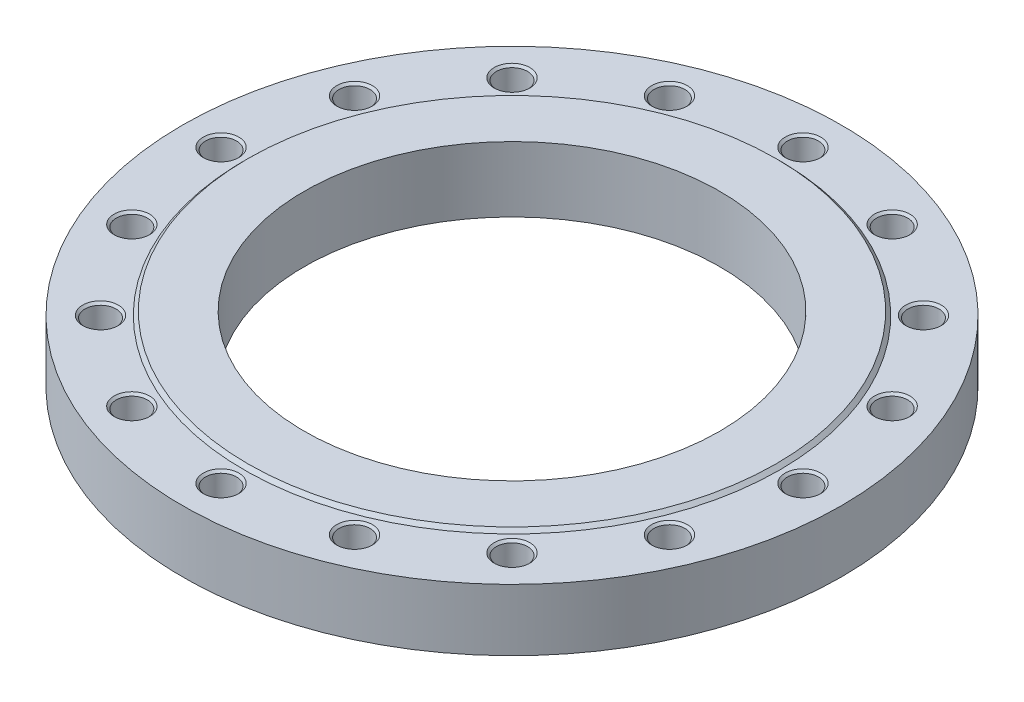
ISO-10303-21;
HEADER;
FILE_DESCRIPTION(('STEP AP214'),'2;1');
FILE_NAME('part.step','',(''),(''),'','','');
FILE_SCHEMA(('AUTOMOTIVE_DESIGN { 1 0 10303 214 1 1 1 1 }'));
ENDSEC;
DATA;
#1=APPLICATION_CONTEXT('core data for automotive mechanical design processes');
#2=APPLICATION_PROTOCOL_DEFINITION('international standard','automotive_design',2000,#1);
#3=PRODUCT_CONTEXT('',#1,'mechanical');
#4=PRODUCT('Part','Part','',(#3));
#5=PRODUCT_RELATED_PRODUCT_CATEGORY('part','',(#4));
#6=PRODUCT_DEFINITION_FORMATION('','',#4);
#7=PRODUCT_DEFINITION_CONTEXT('part definition',#1,'design');
#8=PRODUCT_DEFINITION('design','',#6,#7);
#9=PRODUCT_DEFINITION_SHAPE('','',#8);
#10=(LENGTH_UNIT() NAMED_UNIT(*) SI_UNIT(.MILLI.,.METRE.));
#11=(NAMED_UNIT(*) PLANE_ANGLE_UNIT() SI_UNIT($,.RADIAN.));
#12=(NAMED_UNIT(*) SI_UNIT($,.STERADIAN.) SOLID_ANGLE_UNIT());
#13=UNCERTAINTY_MEASURE_WITH_UNIT(LENGTH_MEASURE(1.E-05),#10,'distance_accuracy_value','');
#14=(GEOMETRIC_REPRESENTATION_CONTEXT(3) GLOBAL_UNCERTAINTY_ASSIGNED_CONTEXT((#13)) GLOBAL_UNIT_ASSIGNED_CONTEXT((#10,
#11,#12)) REPRESENTATION_CONTEXT('',''));
#15=CARTESIAN_POINT('',(0.,0.,0.));
#16=DIRECTION('',(0.,0.,1.));
#17=DIRECTION('',(1.,0.,0.));
#18=AXIS2_PLACEMENT_3D('',#15,#16,#17);
#19=CARTESIAN_POINT('',(0.,26.,0.));
#20=DIRECTION('',(0.,-1.,0.));
#21=DIRECTION('',(1.,0.,0.));
#22=AXIS2_PLACEMENT_3D('',#19,#20,#21);
#23=CYLINDRICAL_SURFACE('',#22,277.5);
#24=CARTESIAN_POINT('',(0.,0.,0.));
#25=DIRECTION('',(0.,1.,0.));
#26=DIRECTION('',(1.,0.,0.));
#27=AXIS2_PLACEMENT_3D('',#24,#25,#26);
#28=CIRCLE('',#27,277.5);
#29=CARTESIAN_POINT('',(277.5,0.,0.));
#30=VERTEX_POINT('',#29);
#31=EDGE_CURVE('E9',#30,#30,#28,.T.);
#32=ORIENTED_EDGE('',*,*,#31,.T.);
#33=EDGE_LOOP('',(#32));
#34=FACE_BOUND('',#33,.T.);
#35=CARTESIAN_POINT('',(0.,52.,0.));
#36=DIRECTION('',(0.,1.,0.));
#37=DIRECTION('',(1.,0.,0.));
#38=AXIS2_PLACEMENT_3D('',#35,#36,#37);
#39=CIRCLE('',#38,277.5);
#40=CARTESIAN_POINT('',(277.5,52.,0.));
#41=VERTEX_POINT('',#40);
#42=EDGE_CURVE('E409',#41,#41,#39,.T.);
#43=ORIENTED_EDGE('',*,*,#42,.F.);
#44=EDGE_LOOP('',(#43));
#45=FACE_BOUND('',#44,.T.);
#46=ADVANCED_FACE('F15',(#34,#45),#23,.T.);
#47=CARTESIAN_POINT('',(226.25,0.,0.));
#48=DIRECTION('',(0.,-1.,0.));
#49=DIRECTION('',(-1.,0.,0.));
#50=AXIS2_PLACEMENT_3D('',#47,#48,#49);
#51=PLANE('',#50);
#52=CARTESIAN_POINT('',(0.,0.,0.));
#53=DIRECTION('',(0.,1.,0.));
#54=DIRECTION('',(1.,0.,0.));
#55=AXIS2_PLACEMENT_3D('',#52,#53,#54);
#56=CIRCLE('',#55,175.);
#57=CARTESIAN_POINT('',(175.,0.,0.));
#58=VERTEX_POINT('',#57);
#59=EDGE_CURVE('E24',#58,#58,#56,.T.);
#60=ORIENTED_EDGE('',*,*,#59,.T.);
#61=EDGE_LOOP('',(#60));
#62=FACE_BOUND('',#61,.T.);
#63=ORIENTED_EDGE('',*,*,#31,.F.);
#64=EDGE_LOOP('',(#63));
#65=FACE_BOUND('',#64,.T.);
#66=ADVANCED_FACE('F17',(#62,#65),#51,.T.);
#67=CARTESIAN_POINT('',(0.,27.5,0.));
#68=DIRECTION('',(0.,-1.,0.));
#69=DIRECTION('',(1.,0.,0.));
#70=AXIS2_PLACEMENT_3D('',#67,#68,#69);
#71=CYLINDRICAL_SURFACE('',#70,175.);
#72=CARTESIAN_POINT('',(0.,55.,0.));
#73=DIRECTION('',(0.,1.,0.));
#74=DIRECTION('',(1.,0.,0.));
#75=AXIS2_PLACEMENT_3D('',#72,#73,#74);
#76=CIRCLE('',#75,175.);
#77=CARTESIAN_POINT('',(175.,55.,0.));
#78=VERTEX_POINT('',#77);
#79=EDGE_CURVE('E413',#78,#78,#76,.T.);
#80=ORIENTED_EDGE('',*,*,#79,.T.);
#81=EDGE_LOOP('',(#80));
#82=FACE_BOUND('',#81,.T.);
#83=ORIENTED_EDGE('',*,*,#59,.F.);
#84=EDGE_LOOP('',(#83));
#85=FACE_BOUND('',#84,.T.);
#86=ADVANCED_FACE('F628',(#82,#85),#71,.F.);
#87=CARTESIAN_POINT('',(198.75,55.,0.));
#88=DIRECTION('',(0.,1.,0.));
#89=DIRECTION('',(1.,0.,0.));
#90=AXIS2_PLACEMENT_3D('',#87,#88,#89);
#91=PLANE('',#90);
#92=CARTESIAN_POINT('',(0.,55.,0.));
#93=DIRECTION('',(0.,1.,0.));
#94=DIRECTION('',(1.,0.,0.));
#95=AXIS2_PLACEMENT_3D('',#92,#93,#94);
#96=CIRCLE('',#95,222.5);
#97=CARTESIAN_POINT('',(222.5,55.,0.));
#98=VERTEX_POINT('',#97);
#99=EDGE_CURVE('E411',#98,#98,#96,.T.);
#100=ORIENTED_EDGE('',*,*,#99,.T.);
#101=EDGE_LOOP('',(#100));
#102=FACE_BOUND('',#101,.T.);
#103=ORIENTED_EDGE('',*,*,#79,.F.);
#104=EDGE_LOOP('',(#103));
#105=FACE_BOUND('',#104,.T.);
#106=ADVANCED_FACE('F708',(#102,#105),#91,.T.);
#107=CARTESIAN_POINT('',(0.,53.5,0.));
#108=DIRECTION('',(0.,-1.,0.));
#109=DIRECTION('',(1.,0.,0.));
#110=AXIS2_PLACEMENT_3D('',#107,#108,#109);
#111=CONICAL_SURFACE('',#110,224.,0.785398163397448);
#112=CARTESIAN_POINT('',(0.,52.,0.));
#113=DIRECTION('',(0.,1.,0.));
#114=DIRECTION('',(1.,0.,0.));
#115=AXIS2_PLACEMENT_3D('',#112,#113,#114);
#116=CIRCLE('',#115,225.5);
#117=CARTESIAN_POINT('',(225.5,52.,0.));
#118=VERTEX_POINT('',#117);
#119=EDGE_CURVE('E412',#118,#118,#116,.T.);
#120=ORIENTED_EDGE('',*,*,#119,.T.);
#121=EDGE_LOOP('',(#120));
#122=FACE_BOUND('',#121,.T.);
#123=ORIENTED_EDGE('',*,*,#99,.F.);
#124=EDGE_LOOP('',(#123));
#125=FACE_BOUND('',#124,.T.);
#126=ADVANCED_FACE('F705',(#122,#125),#111,.T.);
#127=CARTESIAN_POINT('',(251.5,52.,0.));
#128=DIRECTION('',(0.,1.,0.));
#129=DIRECTION('',(1.,0.,0.));
#130=AXIS2_PLACEMENT_3D('',#127,#128,#129);
#131=PLANE('',#130);
#132=ORIENTED_EDGE('',*,*,#42,.T.);
#133=EDGE_LOOP('',(#132));
#134=FACE_BOUND('',#133,.T.);
#135=ORIENTED_EDGE('',*,*,#119,.F.);
#136=EDGE_LOOP('',(#135));
#137=FACE_BOUND('',#136,.T.);
#138=CARTESIAN_POINT('',(245.,52.,0.));
#139=DIRECTION('',(0.,-1.,0.));
#140=DIRECTION('',(1.,0.,0.));
#141=AXIS2_PLACEMENT_3D('',#138,#139,#140);
#142=CIRCLE('',#141,15.);
#143=CARTESIAN_POINT('',(260.,52.,0.));
#144=VERTEX_POINT('',#143);
#145=EDGE_CURVE('E408',#144,#144,#142,.T.);
#146=ORIENTED_EDGE('',*,*,#145,.T.);
#147=EDGE_LOOP('',(#146));
#148=FACE_BOUND('',#147,.T.);
#149=CARTESIAN_POINT('',(226.350485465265,52.,-93.757440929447));
#150=DIRECTION('',(0.,-1.,0.));
#151=DIRECTION('',(0.923879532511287,0.,-0.38268343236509));
#152=AXIS2_PLACEMENT_3D('',#149,#150,#151);
#153=CIRCLE('',#152,15.);
#154=CARTESIAN_POINT('',(240.208678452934,52.,-99.4976924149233));
#155=VERTEX_POINT('',#154);
#156=EDGE_CURVE('E398',#155,#155,#153,.T.);
#157=ORIENTED_EDGE('',*,*,#156,.T.);
#158=EDGE_LOOP('',(#157));
#159=FACE_BOUND('',#158,.T.);
#160=CARTESIAN_POINT('',(173.241161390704,52.,-173.241161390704));
#161=DIRECTION('',(0.,-1.,0.));
#162=DIRECTION('',(0.707106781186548,0.,-0.707106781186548));
#163=AXIS2_PLACEMENT_3D('',#160,#161,#162);
#164=CIRCLE('',#163,15.);
#165=CARTESIAN_POINT('',(183.847763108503,52.,-183.847763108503));
#166=VERTEX_POINT('',#165);
#167=EDGE_CURVE('E380',#166,#166,#164,.T.);
#168=ORIENTED_EDGE('',*,*,#167,.T.);
#169=EDGE_LOOP('',(#168));
#170=FACE_BOUND('',#169,.T.);
#171=CARTESIAN_POINT('',(93.757440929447,52.,-226.350485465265));
#172=DIRECTION('',(0.,-1.,0.));
#173=DIRECTION('',(0.38268343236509,0.,-0.923879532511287));
#174=AXIS2_PLACEMENT_3D('',#171,#172,#173);
#175=CIRCLE('',#174,15.);
#176=CARTESIAN_POINT('',(99.4976924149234,52.,-240.208678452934));
#177=VERTEX_POINT('',#176);
#178=EDGE_CURVE('E511',#177,#177,#175,.T.);
#179=ORIENTED_EDGE('',*,*,#178,.T.);
#180=EDGE_LOOP('',(#179));
#181=FACE_BOUND('',#180,.T.);
#182=CARTESIAN_POINT('',(0.,52.,-245.));
#183=DIRECTION('',(0.,-1.,0.));
#184=DIRECTION('',(0.,0.,-1.));
#185=AXIS2_PLACEMENT_3D('',#182,#183,#184);
#186=CIRCLE('',#185,15.);
#187=CARTESIAN_POINT('',(0.,52.,-260.));
#188=VERTEX_POINT('',#187);
#189=EDGE_CURVE('E435',#188,#188,#186,.T.);
#190=ORIENTED_EDGE('',*,*,#189,.T.);
#191=EDGE_LOOP('',(#190));
#192=FACE_BOUND('',#191,.T.);
#193=CARTESIAN_POINT('',(-93.757440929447,52.,-226.350485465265));
#194=DIRECTION('',(0.,-1.,0.));
#195=DIRECTION('',(-0.38268343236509,0.,-0.923879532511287));
#196=AXIS2_PLACEMENT_3D('',#193,#194,#195);
#197=CIRCLE('',#196,15.);
#198=CARTESIAN_POINT('',(-99.4976924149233,52.,-240.208678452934));
#199=VERTEX_POINT('',#198);
#200=EDGE_CURVE('E426',#199,#199,#197,.T.);
#201=ORIENTED_EDGE('',*,*,#200,.T.);
#202=EDGE_LOOP('',(#201));
#203=FACE_BOUND('',#202,.T.);
#204=CARTESIAN_POINT('',(-173.241161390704,52.,-173.241161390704));
#205=DIRECTION('',(0.,-1.,0.));
#206=DIRECTION('',(-0.707106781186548,0.,-0.707106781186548));
#207=AXIS2_PLACEMENT_3D('',#204,#205,#206);
#208=CIRCLE('',#207,15.);
#209=CARTESIAN_POINT('',(-183.847763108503,52.,-183.847763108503));
#210=VERTEX_POINT('',#209);
#211=EDGE_CURVE('E493',#210,#210,#208,.T.);
#212=ORIENTED_EDGE('',*,*,#211,.T.);
#213=EDGE_LOOP('',(#212));
#214=FACE_BOUND('',#213,.T.);
#215=CARTESIAN_POINT('',(-226.350485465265,52.,-93.757440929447));
#216=DIRECTION('',(0.,-1.,0.));
#217=DIRECTION('',(-0.923879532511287,0.,-0.38268343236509));
#218=AXIS2_PLACEMENT_3D('',#215,#216,#217);
#219=CIRCLE('',#218,15.);
#220=CARTESIAN_POINT('',(-240.208678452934,52.,-99.4976924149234));
#221=VERTEX_POINT('',#220);
#222=EDGE_CURVE('E477',#221,#221,#219,.T.);
#223=ORIENTED_EDGE('',*,*,#222,.T.);
#224=EDGE_LOOP('',(#223));
#225=FACE_BOUND('',#224,.T.);
#226=CARTESIAN_POINT('',(-245.,52.,0.));
#227=DIRECTION('',(0.,-1.,0.));
#228=DIRECTION('',(-1.,0.,0.));
#229=AXIS2_PLACEMENT_3D('',#226,#227,#228);
#230=CIRCLE('',#229,15.);
#231=CARTESIAN_POINT('',(-260.,52.,0.));
#232=VERTEX_POINT('',#231);
#233=EDGE_CURVE('E460',#232,#232,#230,.T.);
#234=ORIENTED_EDGE('',*,*,#233,.T.);
#235=EDGE_LOOP('',(#234));
#236=FACE_BOUND('',#235,.T.);
#237=CARTESIAN_POINT('',(-226.350485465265,52.,93.757440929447));
#238=DIRECTION('',(0.,-1.,0.));
#239=DIRECTION('',(-0.923879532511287,0.,0.38268343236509));
#240=AXIS2_PLACEMENT_3D('',#237,#238,#239);
#241=CIRCLE('',#240,15.);
#242=CARTESIAN_POINT('',(-240.208678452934,52.,99.4976924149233));
#243=VERTEX_POINT('',#242);
#244=EDGE_CURVE('E446',#243,#243,#241,.T.);
#245=ORIENTED_EDGE('',*,*,#244,.T.);
#246=EDGE_LOOP('',(#245));
#247=FACE_BOUND('',#246,.T.);
#248=CARTESIAN_POINT('',(-173.241161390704,52.,173.241161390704));
#249=DIRECTION('',(0.,-1.,0.));
#250=DIRECTION('',(-0.707106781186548,0.,0.707106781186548));
#251=AXIS2_PLACEMENT_3D('',#248,#249,#250);
#252=CIRCLE('',#251,15.);
#253=CARTESIAN_POINT('',(-183.847763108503,52.,183.847763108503));
#254=VERTEX_POINT('',#253);
#255=EDGE_CURVE('E423',#254,#254,#252,.T.);
#256=ORIENTED_EDGE('',*,*,#255,.T.);
#257=EDGE_LOOP('',(#256));
#258=FACE_BOUND('',#257,.T.);
#259=CARTESIAN_POINT('',(-93.7574409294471,52.,226.350485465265));
#260=DIRECTION('',(0.,-1.,0.));
#261=DIRECTION('',(-0.382683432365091,0.,0.923879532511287));
#262=AXIS2_PLACEMENT_3D('',#259,#260,#261);
#263=CIRCLE('',#262,15.);
#264=CARTESIAN_POINT('',(-99.4976924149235,52.,240.208678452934));
#265=VERTEX_POINT('',#264);
#266=EDGE_CURVE('E577',#265,#265,#263,.T.);
#267=ORIENTED_EDGE('',*,*,#266,.T.);
#268=EDGE_LOOP('',(#267));
#269=FACE_BOUND('',#268,.T.);
#270=CARTESIAN_POINT('',(0.,52.,245.));
#271=DIRECTION('',(0.,-1.,0.));
#272=DIRECTION('',(0.,0.,1.));
#273=AXIS2_PLACEMENT_3D('',#270,#271,#272);
#274=CIRCLE('',#273,15.);
#275=CARTESIAN_POINT('',(0.,52.,260.));
#276=VERTEX_POINT('',#275);
#277=EDGE_CURVE('E568',#276,#276,#274,.T.);
#278=ORIENTED_EDGE('',*,*,#277,.T.);
#279=EDGE_LOOP('',(#278));
#280=FACE_BOUND('',#279,.T.);
#281=CARTESIAN_POINT('',(93.757440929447,52.,226.350485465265));
#282=DIRECTION('',(0.,-1.,0.));
#283=DIRECTION('',(0.38268343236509,0.,0.923879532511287));
#284=AXIS2_PLACEMENT_3D('',#281,#282,#283);
#285=CIRCLE('',#284,15.);
#286=CARTESIAN_POINT('',(99.4976924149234,52.,240.208678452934));
#287=VERTEX_POINT('',#286);
#288=EDGE_CURVE('E521',#287,#287,#285,.T.);
#289=ORIENTED_EDGE('',*,*,#288,.T.);
#290=EDGE_LOOP('',(#289));
#291=FACE_BOUND('',#290,.T.);
#292=CARTESIAN_POINT('',(173.241161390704,52.,173.241161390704));
#293=DIRECTION('',(0.,-1.,0.));
#294=DIRECTION('',(0.707106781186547,0.,0.707106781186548));
#295=AXIS2_PLACEMENT_3D('',#292,#293,#294);
#296=CIRCLE('',#295,15.);
#297=CARTESIAN_POINT('',(183.847763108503,52.,183.847763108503));
#298=VERTEX_POINT('',#297);
#299=EDGE_CURVE('E529',#298,#298,#296,.T.);
#300=ORIENTED_EDGE('',*,*,#299,.T.);
#301=EDGE_LOOP('',(#300));
#302=FACE_BOUND('',#301,.T.);
#303=CARTESIAN_POINT('',(226.350485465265,52.,93.7574409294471));
#304=DIRECTION('',(0.,-1.,0.));
#305=DIRECTION('',(0.923879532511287,0.,0.382683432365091));
#306=AXIS2_PLACEMENT_3D('',#303,#304,#305);
#307=CIRCLE('',#306,15.);
#308=CARTESIAN_POINT('',(240.208678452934,52.,99.4976924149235));
#309=VERTEX_POINT('',#308);
#310=EDGE_CURVE('E534',#309,#309,#307,.T.);
#311=ORIENTED_EDGE('',*,*,#310,.T.);
#312=EDGE_LOOP('',(#311));
#313=FACE_BOUND('',#312,.T.);
#314=ADVANCED_FACE('F702',(#134,#137,#148,#159,#170,#181,#192,#203,#214,#225,#236,#247,#258,
#269,#280,#291,#302,#313),#131,.T.);
#315=CARTESIAN_POINT('',(245.,8.21673193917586,0.));
#316=DIRECTION('',(0.,1.,0.));
#317=DIRECTION('',(1.,0.,0.));
#318=AXIS2_PLACEMENT_3D('',#315,#316,#317);
#319=CONICAL_SURFACE('',#318,6.5528125,1.0471975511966);
#320=CARTESIAN_POINT('',(245.,12.,0.));
#321=DIRECTION('',(0.,-1.,0.));
#322=DIRECTION('',(1.,0.,0.));
#323=AXIS2_PLACEMENT_3D('',#320,#321,#322);
#324=CIRCLE('',#323,13.105625);
#325=CARTESIAN_POINT('',(258.105625,12.,0.));
#326=VERTEX_POINT('',#325);
#327=EDGE_CURVE('E440',#326,#326,#324,.T.);
#328=ORIENTED_EDGE('',*,*,#327,.F.);
#329=EDGE_LOOP('',(#328));
#330=FACE_BOUND('',#329,.T.);
#331=CARTESIAN_POINT('',(245.,4.43346387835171,0.));
#332=VERTEX_POINT('',#331);
#333=VERTEX_LOOP('',#332);
#334=FACE_BOUND('',#333,.T.);
#335=ADVANCED_FACE('F704',(#330,#334),#319,.F.);
#336=CARTESIAN_POINT('',(245.,16.0528125,0.));
#337=DIRECTION('',(0.,1.,0.));
#338=DIRECTION('',(1.,0.,0.));
#339=AXIS2_PLACEMENT_3D('',#336,#337,#338);
#340=CYLINDRICAL_SURFACE('',#339,13.105625);
#341=CARTESIAN_POINT('',(245.,20.105625,0.));
#342=DIRECTION('',(0.,-1.,0.));
#343=DIRECTION('',(1.,0.,0.));
#344=AXIS2_PLACEMENT_3D('',#341,#342,#343);
#345=CIRCLE('',#344,13.105625);
#346=CARTESIAN_POINT('',(258.105625,20.105625,0.));
#347=VERTEX_POINT('',#346);
#348=EDGE_CURVE('E442',#347,#347,#345,.T.);
#349=ORIENTED_EDGE('',*,*,#348,.F.);
#350=EDGE_LOOP('',(#349));
#351=FACE_BOUND('',#350,.T.);
#352=ORIENTED_EDGE('',*,*,#327,.T.);
#353=EDGE_LOOP('',(#352));
#354=FACE_BOUND('',#353,.T.);
#355=ADVANCED_FACE('F700',(#351,#354),#340,.F.);
#356=CARTESIAN_POINT('',(245.,21.0528125,0.));
#357=DIRECTION('',(0.,1.,0.));
#358=DIRECTION('',(1.,0.,0.));
#359=AXIS2_PLACEMENT_3D('',#356,#357,#358);
#360=CONICAL_SURFACE('',#359,14.0528125,0.785398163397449);
#361=CARTESIAN_POINT('',(245.,22.,0.));
#362=DIRECTION('',(0.,-1.,0.));
#363=DIRECTION('',(1.,0.,0.));
#364=AXIS2_PLACEMENT_3D('',#361,#362,#363);
#365=CIRCLE('',#364,15.);
#366=CARTESIAN_POINT('',(260.,22.,0.));
#367=VERTEX_POINT('',#366);
#368=EDGE_CURVE('E471',#367,#367,#365,.T.);
#369=ORIENTED_EDGE('',*,*,#368,.F.);
#370=EDGE_LOOP('',(#369));
#371=FACE_BOUND('',#370,.T.);
#372=ORIENTED_EDGE('',*,*,#348,.T.);
#373=EDGE_LOOP('',(#372));
#374=FACE_BOUND('',#373,.T.);
#375=ADVANCED_FACE('F696',(#371,#374),#360,.F.);
#376=CARTESIAN_POINT('',(259.0528125,22.,0.));
#377=DIRECTION('',(0.,1.,0.));
#378=DIRECTION('',(-1.,0.,0.));
#379=AXIS2_PLACEMENT_3D('',#376,#377,#378);
#380=PLANE('',#379);
#381=CARTESIAN_POINT('',(245.,22.,0.));
#382=DIRECTION('',(0.,-1.,0.));
#383=DIRECTION('',(1.,0.,0.));
#384=AXIS2_PLACEMENT_3D('',#381,#382,#383);
#385=CIRCLE('',#384,13.105625);
#386=CARTESIAN_POINT('',(258.105625,22.,0.));
#387=VERTEX_POINT('',#386);
#388=EDGE_CURVE('E451',#387,#387,#385,.T.);
#389=ORIENTED_EDGE('',*,*,#388,.F.);
#390=EDGE_LOOP('',(#389));
#391=FACE_BOUND('',#390,.T.);
#392=ORIENTED_EDGE('',*,*,#368,.T.);
#393=EDGE_LOOP('',(#392));
#394=FACE_BOUND('',#393,.T.);
#395=ADVANCED_FACE('F699',(#391,#394),#380,.F.);
#396=CARTESIAN_POINT('',(245.,36.0528125,0.));
#397=DIRECTION('',(0.,1.,0.));
#398=DIRECTION('',(1.,0.,0.));
#399=AXIS2_PLACEMENT_3D('',#396,#397,#398);
#400=CYLINDRICAL_SURFACE('',#399,13.105625);
#401=CARTESIAN_POINT('',(245.,50.105625,0.));
#402=DIRECTION('',(0.,-1.,0.));
#403=DIRECTION('',(1.,0.,0.));
#404=AXIS2_PLACEMENT_3D('',#401,#402,#403);
#405=CIRCLE('',#404,13.105625);
#406=CARTESIAN_POINT('',(258.105625,50.105625,0.));
#407=VERTEX_POINT('',#406);
#408=EDGE_CURVE('E405',#407,#407,#405,.T.);
#409=ORIENTED_EDGE('',*,*,#408,.F.);
#410=EDGE_LOOP('',(#409));
#411=FACE_BOUND('',#410,.T.);
#412=ORIENTED_EDGE('',*,*,#388,.T.);
#413=EDGE_LOOP('',(#412));
#414=FACE_BOUND('',#413,.T.);
#415=ADVANCED_FACE('F694',(#411,#414),#400,.F.);
#416=CARTESIAN_POINT('',(245.,51.0528125,0.));
#417=DIRECTION('',(0.,1.,0.));
#418=DIRECTION('',(1.,0.,0.));
#419=AXIS2_PLACEMENT_3D('',#416,#417,#418);
#420=CONICAL_SURFACE('',#419,14.0528125,0.785398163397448);
#421=ORIENTED_EDGE('',*,*,#145,.F.);
#422=EDGE_LOOP('',(#421));
#423=FACE_BOUND('',#422,.T.);
#424=ORIENTED_EDGE('',*,*,#408,.T.);
#425=EDGE_LOOP('',(#424));
#426=FACE_BOUND('',#425,.T.);
#427=ADVANCED_FACE('F690',(#423,#426),#420,.F.);
#428=CARTESIAN_POINT('',(226.350485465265,8.21673193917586,-93.757440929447));
#429=DIRECTION('',(0.,1.,0.));
#430=DIRECTION('',(0.923879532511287,0.,-0.38268343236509));
#431=AXIS2_PLACEMENT_3D('',#428,#429,#430);
#432=CONICAL_SURFACE('',#431,6.5528125,1.0471975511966);
#433=CARTESIAN_POINT('',(226.350485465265,12.,-93.757440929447));
#434=DIRECTION('',(0.,-1.,0.));
#435=DIRECTION('',(0.923879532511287,0.,-0.38268343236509));
#436=AXIS2_PLACEMENT_3D('',#433,#434,#435);
#437=CIRCLE('',#436,13.105625);
#438=CARTESIAN_POINT('',(238.458504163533,12.,-98.7727464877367));
#439=VERTEX_POINT('',#438);
#440=EDGE_CURVE('E403',#439,#439,#437,.T.);
#441=ORIENTED_EDGE('',*,*,#440,.F.);
#442=EDGE_LOOP('',(#441));
#443=FACE_BOUND('',#442,.T.);
#444=CARTESIAN_POINT('',(226.350485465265,4.43346387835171,-93.757440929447));
#445=VERTEX_POINT('',#444);
#446=VERTEX_LOOP('',#445);
#447=FACE_BOUND('',#446,.T.);
#448=ADVANCED_FACE('F693',(#443,#447),#432,.F.);
#449=CARTESIAN_POINT('',(226.350485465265,16.0528125,-93.757440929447));
#450=DIRECTION('',(0.,1.,0.));
#451=DIRECTION('',(0.923879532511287,0.,-0.38268343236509));
#452=AXIS2_PLACEMENT_3D('',#449,#450,#451);
#453=CYLINDRICAL_SURFACE('',#452,13.105625);
#454=CARTESIAN_POINT('',(226.350485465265,20.105625,-93.757440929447));
#455=DIRECTION('',(0.,-1.,0.));
#456=DIRECTION('',(0.923879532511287,0.,-0.38268343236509));
#457=AXIS2_PLACEMENT_3D('',#454,#455,#456);
#458=CIRCLE('',#457,13.105625);
#459=CARTESIAN_POINT('',(238.458504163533,20.105625,-98.7727464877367));
#460=VERTEX_POINT('',#459);
#461=EDGE_CURVE('E406',#460,#460,#458,.T.);
#462=ORIENTED_EDGE('',*,*,#461,.F.);
#463=EDGE_LOOP('',(#462));
#464=FACE_BOUND('',#463,.T.);
#465=ORIENTED_EDGE('',*,*,#440,.T.);
#466=EDGE_LOOP('',(#465));
#467=FACE_BOUND('',#466,.T.);
#468=ADVANCED_FACE('F806',(#464,#467),#453,.F.);
#469=CARTESIAN_POINT('',(226.350485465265,21.0528125,-93.757440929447));
#470=DIRECTION('',(0.,1.,0.));
#471=DIRECTION('',(0.923879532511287,0.,-0.38268343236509));
#472=AXIS2_PLACEMENT_3D('',#469,#470,#471);
#473=CONICAL_SURFACE('',#472,14.0528125,0.785398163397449);
#474=CARTESIAN_POINT('',(226.350485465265,22.,-93.757440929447));
#475=DIRECTION('',(0.,-1.,0.));
#476=DIRECTION('',(0.923879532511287,0.,-0.38268343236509));
#477=AXIS2_PLACEMENT_3D('',#474,#475,#476);
#478=CIRCLE('',#477,15.);
#479=CARTESIAN_POINT('',(240.208678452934,22.,-99.4976924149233));
#480=VERTEX_POINT('',#479);
#481=EDGE_CURVE('E402',#480,#480,#478,.T.);
#482=ORIENTED_EDGE('',*,*,#481,.F.);
#483=EDGE_LOOP('',(#482));
#484=FACE_BOUND('',#483,.T.);
#485=ORIENTED_EDGE('',*,*,#461,.T.);
#486=EDGE_LOOP('',(#485));
#487=FACE_BOUND('',#486,.T.);
#488=ADVANCED_FACE('F688',(#484,#487),#473,.F.);
#489=CARTESIAN_POINT('',(239.333591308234,22.,-99.13521945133));
#490=DIRECTION('',(0.,1.,0.));
#491=DIRECTION('',(-0.923879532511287,0.,0.38268343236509));
#492=AXIS2_PLACEMENT_3D('',#489,#490,#491);
#493=PLANE('',#492);
#494=CARTESIAN_POINT('',(226.350485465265,22.,-93.757440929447));
#495=DIRECTION('',(0.,-1.,0.));
#496=DIRECTION('',(0.923879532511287,0.,-0.38268343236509));
#497=AXIS2_PLACEMENT_3D('',#494,#495,#496);
#498=CIRCLE('',#497,13.105625);
#499=CARTESIAN_POINT('',(238.458504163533,22.,-98.7727464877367));
#500=VERTEX_POINT('',#499);
#501=EDGE_CURVE('E400',#500,#500,#498,.T.);
#502=ORIENTED_EDGE('',*,*,#501,.F.);
#503=EDGE_LOOP('',(#502));
#504=FACE_BOUND('',#503,.T.);
#505=ORIENTED_EDGE('',*,*,#481,.T.);
#506=EDGE_LOOP('',(#505));
#507=FACE_BOUND('',#506,.T.);
#508=ADVANCED_FACE('F684',(#504,#507),#493,.F.);
#509=CARTESIAN_POINT('',(226.350485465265,36.0528125,-93.757440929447));
#510=DIRECTION('',(0.,1.,0.));
#511=DIRECTION('',(0.923879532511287,0.,-0.38268343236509));
#512=AXIS2_PLACEMENT_3D('',#509,#510,#511);
#513=CYLINDRICAL_SURFACE('',#512,13.105625);
#514=CARTESIAN_POINT('',(226.350485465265,50.105625,-93.757440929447));
#515=DIRECTION('',(0.,-1.,0.));
#516=DIRECTION('',(0.923879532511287,0.,-0.38268343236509));
#517=AXIS2_PLACEMENT_3D('',#514,#515,#516);
#518=CIRCLE('',#517,13.105625);
#519=CARTESIAN_POINT('',(238.458504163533,50.105625,-98.7727464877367));
#520=VERTEX_POINT('',#519);
#521=EDGE_CURVE('E396',#520,#520,#518,.T.);
#522=ORIENTED_EDGE('',*,*,#521,.F.);
#523=EDGE_LOOP('',(#522));
#524=FACE_BOUND('',#523,.T.);
#525=ORIENTED_EDGE('',*,*,#501,.T.);
#526=EDGE_LOOP('',(#525));
#527=FACE_BOUND('',#526,.T.);
#528=ADVANCED_FACE('F680',(#524,#527),#513,.F.);
#529=CARTESIAN_POINT('',(226.350485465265,51.0528125,-93.757440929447));
#530=DIRECTION('',(0.,1.,0.));
#531=DIRECTION('',(0.923879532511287,0.,-0.38268343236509));
#532=AXIS2_PLACEMENT_3D('',#529,#530,#531);
#533=CONICAL_SURFACE('',#532,14.0528125,0.785398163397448);
#534=ORIENTED_EDGE('',*,*,#156,.F.);
#535=EDGE_LOOP('',(#534));
#536=FACE_BOUND('',#535,.T.);
#537=ORIENTED_EDGE('',*,*,#521,.T.);
#538=EDGE_LOOP('',(#537));
#539=FACE_BOUND('',#538,.T.);
#540=ADVANCED_FACE('F676',(#536,#539),#533,.F.);
#541=CARTESIAN_POINT('',(173.241161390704,8.21673193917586,-173.241161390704));
#542=DIRECTION('',(0.,1.,0.));
#543=DIRECTION('',(0.707106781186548,0.,-0.707106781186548));
#544=AXIS2_PLACEMENT_3D('',#541,#542,#543);
#545=CONICAL_SURFACE('',#544,6.5528125,1.0471975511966);
#546=CARTESIAN_POINT('',(173.241161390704,12.,-173.241161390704));
#547=DIRECTION('',(0.,-1.,0.));
#548=DIRECTION('',(0.707106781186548,0.,-0.707106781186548));
#549=AXIS2_PLACEMENT_3D('',#546,#547,#548);
#550=CIRCLE('',#549,13.105625);
#551=CARTESIAN_POINT('',(182.508237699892,12.,-182.508237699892));
#552=VERTEX_POINT('',#551);
#553=EDGE_CURVE('E394',#552,#552,#550,.T.);
#554=ORIENTED_EDGE('',*,*,#553,.F.);
#555=EDGE_LOOP('',(#554));
#556=FACE_BOUND('',#555,.T.);
#557=CARTESIAN_POINT('',(173.241161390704,4.43346387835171,-173.241161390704));
#558=VERTEX_POINT('',#557);
#559=VERTEX_LOOP('',#558);
#560=FACE_BOUND('',#559,.T.);
#561=ADVANCED_FACE('F672',(#556,#560),#545,.F.);
#562=CARTESIAN_POINT('',(173.241161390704,16.0528125,-173.241161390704));
#563=DIRECTION('',(0.,1.,0.));
#564=DIRECTION('',(0.707106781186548,0.,-0.707106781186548));
#565=AXIS2_PLACEMENT_3D('',#562,#563,#564);
#566=CYLINDRICAL_SURFACE('',#565,13.105625);
#567=CARTESIAN_POINT('',(173.241161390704,20.105625,-173.241161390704));
#568=DIRECTION('',(0.,-1.,0.));
#569=DIRECTION('',(0.707106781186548,0.,-0.707106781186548));
#570=AXIS2_PLACEMENT_3D('',#567,#568,#569);
#571=CIRCLE('',#570,13.105625);
#572=CARTESIAN_POINT('',(182.508237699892,20.105625,-182.508237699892));
#573=VERTEX_POINT('',#572);
#574=EDGE_CURVE('E392',#573,#573,#571,.T.);
#575=ORIENTED_EDGE('',*,*,#574,.F.);
#576=EDGE_LOOP('',(#575));
#577=FACE_BOUND('',#576,.T.);
#578=ORIENTED_EDGE('',*,*,#553,.T.);
#579=EDGE_LOOP('',(#578));
#580=FACE_BOUND('',#579,.T.);
#581=ADVANCED_FACE('F675',(#577,#580),#566,.F.);
#582=CARTESIAN_POINT('',(173.241161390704,21.0528125,-173.241161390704));
#583=DIRECTION('',(0.,1.,0.));
#584=DIRECTION('',(0.707106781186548,0.,-0.707106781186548));
#585=AXIS2_PLACEMENT_3D('',#582,#583,#584);
#586=CONICAL_SURFACE('',#585,14.0528125,0.785398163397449);
#587=CARTESIAN_POINT('',(173.241161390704,22.,-173.241161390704));
#588=DIRECTION('',(0.,-1.,0.));
#589=DIRECTION('',(0.707106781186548,0.,-0.707106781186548));
#590=AXIS2_PLACEMENT_3D('',#587,#588,#589);
#591=CIRCLE('',#590,15.);
#592=CARTESIAN_POINT('',(183.847763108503,22.,-183.847763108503));
#593=VERTEX_POINT('',#592);
#594=EDGE_CURVE('E390',#593,#593,#591,.T.);
#595=ORIENTED_EDGE('',*,*,#594,.F.);
#596=EDGE_LOOP('',(#595));
#597=FACE_BOUND('',#596,.T.);
#598=ORIENTED_EDGE('',*,*,#574,.T.);
#599=EDGE_LOOP('',(#598));
#600=FACE_BOUND('',#599,.T.);
#601=ADVANCED_FACE('F791',(#597,#600),#586,.F.);
#602=CARTESIAN_POINT('',(183.178000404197,22.,-183.178000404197));
#603=DIRECTION('',(0.,1.,0.));
#604=DIRECTION('',(-0.707106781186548,0.,0.707106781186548));
#605=AXIS2_PLACEMENT_3D('',#602,#603,#604);
#606=PLANE('',#605);
#607=CARTESIAN_POINT('',(173.241161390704,22.,-173.241161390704));
#608=DIRECTION('',(0.,-1.,0.));
#609=DIRECTION('',(0.707106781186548,0.,-0.707106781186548));
#610=AXIS2_PLACEMENT_3D('',#607,#608,#609);
#611=CIRCLE('',#610,13.105625);
#612=CARTESIAN_POINT('',(182.508237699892,22.,-182.508237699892));
#613=VERTEX_POINT('',#612);
#614=EDGE_CURVE('E389',#613,#613,#611,.T.);
#615=ORIENTED_EDGE('',*,*,#614,.F.);
#616=EDGE_LOOP('',(#615));
#617=FACE_BOUND('',#616,.T.);
#618=ORIENTED_EDGE('',*,*,#594,.T.);
#619=EDGE_LOOP('',(#618));
#620=FACE_BOUND('',#619,.T.);
#621=ADVANCED_FACE('F788',(#617,#620),#606,.F.);
#622=CARTESIAN_POINT('',(173.241161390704,36.0528125,-173.241161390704));
#623=DIRECTION('',(0.,1.,0.));
#624=DIRECTION('',(0.707106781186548,0.,-0.707106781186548));
#625=AXIS2_PLACEMENT_3D('',#622,#623,#624);
#626=CYLINDRICAL_SURFACE('',#625,13.105625);
#627=CARTESIAN_POINT('',(173.241161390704,50.105625,-173.241161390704));
#628=DIRECTION('',(0.,-1.,0.));
#629=DIRECTION('',(0.707106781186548,0.,-0.707106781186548));
#630=AXIS2_PLACEMENT_3D('',#627,#628,#629);
#631=CIRCLE('',#630,13.105625);
#632=CARTESIAN_POINT('',(182.508237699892,50.105625,-182.508237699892));
#633=VERTEX_POINT('',#632);
#634=EDGE_CURVE('E377',#633,#633,#631,.T.);
#635=ORIENTED_EDGE('',*,*,#634,.F.);
#636=EDGE_LOOP('',(#635));
#637=FACE_BOUND('',#636,.T.);
#638=ORIENTED_EDGE('',*,*,#614,.T.);
#639=EDGE_LOOP('',(#638));
#640=FACE_BOUND('',#639,.T.);
#641=ADVANCED_FACE('F670',(#637,#640),#626,.F.);
#642=CARTESIAN_POINT('',(173.241161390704,51.0528125,-173.241161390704));
#643=DIRECTION('',(0.,1.,0.));
#644=DIRECTION('',(0.707106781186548,0.,-0.707106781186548));
#645=AXIS2_PLACEMENT_3D('',#642,#643,#644);
#646=CONICAL_SURFACE('',#645,14.0528125,0.785398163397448);
#647=ORIENTED_EDGE('',*,*,#167,.F.);
#648=EDGE_LOOP('',(#647));
#649=FACE_BOUND('',#648,.T.);
#650=ORIENTED_EDGE('',*,*,#634,.T.);
#651=EDGE_LOOP('',(#650));
#652=FACE_BOUND('',#651,.T.);
#653=ADVANCED_FACE('F667',(#649,#652),#646,.F.);
#654=CARTESIAN_POINT('',(93.757440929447,8.21673193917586,-226.350485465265));
#655=DIRECTION('',(0.,1.,0.));
#656=DIRECTION('',(0.38268343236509,0.,-0.923879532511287));
#657=AXIS2_PLACEMENT_3D('',#654,#655,#656);
#658=CONICAL_SURFACE('',#657,6.5528125,1.0471975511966);
#659=CARTESIAN_POINT('',(93.757440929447,12.,-226.350485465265));
#660=DIRECTION('',(0.,-1.,0.));
#661=DIRECTION('',(0.38268343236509,0.,-0.923879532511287));
#662=AXIS2_PLACEMENT_3D('',#659,#660,#661);
#663=CIRCLE('',#662,13.105625);
#664=CARTESIAN_POINT('',(98.7727464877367,12.,-238.458504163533));
#665=VERTEX_POINT('',#664);
#666=EDGE_CURVE('E374',#665,#665,#663,.T.);
#667=ORIENTED_EDGE('',*,*,#666,.F.);
#668=EDGE_LOOP('',(#667));
#669=FACE_BOUND('',#668,.T.);
#670=CARTESIAN_POINT('',(93.757440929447,4.43346387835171,-226.350485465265));
#671=VERTEX_POINT('',#670);
#672=VERTEX_LOOP('',#671);
#673=FACE_BOUND('',#672,.T.);
#674=ADVANCED_FACE('F663',(#669,#673),#658,.F.);
#675=CARTESIAN_POINT('',(93.757440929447,16.0528125,-226.350485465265));
#676=DIRECTION('',(0.,1.,0.));
#677=DIRECTION('',(0.38268343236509,0.,-0.923879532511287));
#678=AXIS2_PLACEMENT_3D('',#675,#676,#677);
#679=CYLINDRICAL_SURFACE('',#678,13.105625);
#680=CARTESIAN_POINT('',(93.757440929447,20.105625,-226.350485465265));
#681=DIRECTION('',(0.,-1.,0.));
#682=DIRECTION('',(0.38268343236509,0.,-0.923879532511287));
#683=AXIS2_PLACEMENT_3D('',#680,#681,#682);
#684=CIRCLE('',#683,13.105625);
#685=CARTESIAN_POINT('',(98.7727464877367,20.105625,-238.458504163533));
#686=VERTEX_POINT('',#685);
#687=EDGE_CURVE('E378',#686,#686,#684,.T.);
#688=ORIENTED_EDGE('',*,*,#687,.F.);
#689=EDGE_LOOP('',(#688));
#690=FACE_BOUND('',#689,.T.);
#691=ORIENTED_EDGE('',*,*,#666,.T.);
#692=EDGE_LOOP('',(#691));
#693=FACE_BOUND('',#692,.T.);
#694=ADVANCED_FACE('F375',(#690,#693),#679,.F.);
#695=CARTESIAN_POINT('',(93.757440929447,21.0528125,-226.350485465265));
#696=DIRECTION('',(0.,1.,0.));
#697=DIRECTION('',(0.38268343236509,0.,-0.923879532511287));
#698=AXIS2_PLACEMENT_3D('',#695,#696,#697);
#699=CONICAL_SURFACE('',#698,14.0528125,0.785398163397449);
#700=CARTESIAN_POINT('',(93.757440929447,22.,-226.350485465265));
#701=DIRECTION('',(0.,-1.,0.));
#702=DIRECTION('',(0.38268343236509,0.,-0.923879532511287));
#703=AXIS2_PLACEMENT_3D('',#700,#701,#702);
#704=CIRCLE('',#703,15.);
#705=CARTESIAN_POINT('',(99.4976924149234,22.,-240.208678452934));
#706=VERTEX_POINT('',#705);
#707=EDGE_CURVE('E382',#706,#706,#704,.T.);
#708=ORIENTED_EDGE('',*,*,#707,.F.);
#709=EDGE_LOOP('',(#708));
#710=FACE_BOUND('',#709,.T.);
#711=ORIENTED_EDGE('',*,*,#687,.T.);
#712=EDGE_LOOP('',(#711));
#713=FACE_BOUND('',#712,.T.);
#714=ADVANCED_FACE('F662',(#710,#713),#699,.F.);
#715=CARTESIAN_POINT('',(99.1352194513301,22.,-239.333591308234));
#716=DIRECTION('',(0.,1.,0.));
#717=DIRECTION('',(-0.38268343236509,0.,0.923879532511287));
#718=AXIS2_PLACEMENT_3D('',#715,#716,#717);
#719=PLANE('',#718);
#720=CARTESIAN_POINT('',(93.757440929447,22.,-226.350485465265));
#721=DIRECTION('',(0.,-1.,0.));
#722=DIRECTION('',(0.38268343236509,0.,-0.923879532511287));
#723=AXIS2_PLACEMENT_3D('',#720,#721,#722);
#724=CIRCLE('',#723,13.105625);
#725=CARTESIAN_POINT('',(98.7727464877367,22.,-238.458504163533));
#726=VERTEX_POINT('',#725);
#727=EDGE_CURVE('E514',#726,#726,#724,.T.);
#728=ORIENTED_EDGE('',*,*,#727,.F.);
#729=EDGE_LOOP('',(#728));
#730=FACE_BOUND('',#729,.T.);
#731=ORIENTED_EDGE('',*,*,#707,.T.);
#732=EDGE_LOOP('',(#731));
#733=FACE_BOUND('',#732,.T.);
#734=ADVANCED_FACE('F840',(#730,#733),#719,.F.);
#735=CARTESIAN_POINT('',(93.757440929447,36.0528125,-226.350485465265));
#736=DIRECTION('',(0.,1.,0.));
#737=DIRECTION('',(0.38268343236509,0.,-0.923879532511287));
#738=AXIS2_PLACEMENT_3D('',#735,#736,#737);
#739=CYLINDRICAL_SURFACE('',#738,13.105625);
#740=CARTESIAN_POINT('',(93.757440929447,50.105625,-226.350485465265));
#741=DIRECTION('',(0.,-1.,0.));
#742=DIRECTION('',(0.38268343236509,0.,-0.923879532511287));
#743=AXIS2_PLACEMENT_3D('',#740,#741,#742);
#744=CIRCLE('',#743,13.105625);
#745=CARTESIAN_POINT('',(98.7727464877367,50.105625,-238.458504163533));
#746=VERTEX_POINT('',#745);
#747=EDGE_CURVE('E385',#746,#746,#744,.T.);
#748=ORIENTED_EDGE('',*,*,#747,.F.);
#749=EDGE_LOOP('',(#748));
#750=FACE_BOUND('',#749,.T.);
#751=ORIENTED_EDGE('',*,*,#727,.T.);
#752=EDGE_LOOP('',(#751));
#753=FACE_BOUND('',#752,.T.);
#754=ADVANCED_FACE('F934',(#750,#753),#739,.F.);
#755=CARTESIAN_POINT('',(93.757440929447,51.0528125,-226.350485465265));
#756=DIRECTION('',(0.,1.,0.));
#757=DIRECTION('',(0.38268343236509,0.,-0.923879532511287));
#758=AXIS2_PLACEMENT_3D('',#755,#756,#757);
#759=CONICAL_SURFACE('',#758,14.0528125,0.785398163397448);
#760=ORIENTED_EDGE('',*,*,#178,.F.);
#761=EDGE_LOOP('',(#760));
#762=FACE_BOUND('',#761,.T.);
#763=ORIENTED_EDGE('',*,*,#747,.T.);
#764=EDGE_LOOP('',(#763));
#765=FACE_BOUND('',#764,.T.);
#766=ADVANCED_FACE('F814',(#762,#765),#759,.F.);
#767=CARTESIAN_POINT('',(0.,8.21673193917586,-245.));
#768=DIRECTION('',(0.,1.,0.));
#769=DIRECTION('',(0.,0.,-1.));
#770=AXIS2_PLACEMENT_3D('',#767,#768,#769);
#771=CONICAL_SURFACE('',#770,6.5528125,1.0471975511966);
#772=CARTESIAN_POINT('',(0.,12.,-245.));
#773=DIRECTION('',(0.,-1.,0.));
#774=DIRECTION('',(0.,0.,-1.));
#775=AXIS2_PLACEMENT_3D('',#772,#773,#774);
#776=CIRCLE('',#775,13.105625);
#777=CARTESIAN_POINT('',(0.,12.,-258.105625));
#778=VERTEX_POINT('',#777);
#779=EDGE_CURVE('E491',#778,#778,#776,.T.);
#780=ORIENTED_EDGE('',*,*,#779,.F.);
#781=EDGE_LOOP('',(#780));
#782=FACE_BOUND('',#781,.T.);
#783=CARTESIAN_POINT('',(0.,4.43346387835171,-245.));
#784=VERTEX_POINT('',#783);
#785=VERTEX_LOOP('',#784);
#786=FACE_BOUND('',#785,.T.);
#787=ADVANCED_FACE('F658',(#782,#786),#771,.F.);
#788=CARTESIAN_POINT('',(0.,16.0528125,-245.));
#789=DIRECTION('',(0.,1.,0.));
#790=DIRECTION('',(0.,0.,-1.));
#791=AXIS2_PLACEMENT_3D('',#788,#789,#790);
#792=CYLINDRICAL_SURFACE('',#791,13.105625);
#793=CARTESIAN_POINT('',(0.,20.105625,-245.));
#794=DIRECTION('',(0.,-1.,0.));
#795=DIRECTION('',(0.,0.,-1.));
#796=AXIS2_PLACEMENT_3D('',#793,#794,#795);
#797=CIRCLE('',#796,13.105625);
#798=CARTESIAN_POINT('',(0.,20.105625,-258.105625));
#799=VERTEX_POINT('',#798);
#800=EDGE_CURVE('E489',#799,#799,#797,.T.);
#801=ORIENTED_EDGE('',*,*,#800,.F.);
#802=EDGE_LOOP('',(#801));
#803=FACE_BOUND('',#802,.T.);
#804=ORIENTED_EDGE('',*,*,#779,.T.);
#805=EDGE_LOOP('',(#804));
#806=FACE_BOUND('',#805,.T.);
#807=ADVANCED_FACE('F654',(#803,#806),#792,.F.);
#808=CARTESIAN_POINT('',(0.,21.0528125,-245.));
#809=DIRECTION('',(0.,1.,0.));
#810=DIRECTION('',(0.,0.,-1.));
#811=AXIS2_PLACEMENT_3D('',#808,#809,#810);
#812=CONICAL_SURFACE('',#811,14.0528125,0.785398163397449);
#813=CARTESIAN_POINT('',(0.,22.,-245.));
#814=DIRECTION('',(0.,-1.,0.));
#815=DIRECTION('',(0.,0.,-1.));
#816=AXIS2_PLACEMENT_3D('',#813,#814,#815);
#817=CIRCLE('',#816,15.);
#818=CARTESIAN_POINT('',(0.,22.,-260.));
#819=VERTEX_POINT('',#818);
#820=EDGE_CURVE('E434',#819,#819,#817,.T.);
#821=ORIENTED_EDGE('',*,*,#820,.F.);
#822=EDGE_LOOP('',(#821));
#823=FACE_BOUND('',#822,.T.);
#824=ORIENTED_EDGE('',*,*,#800,.T.);
#825=EDGE_LOOP('',(#824));
#826=FACE_BOUND('',#825,.T.);
#827=ADVANCED_FACE('F657',(#823,#826),#812,.F.);
#828=CARTESIAN_POINT('',(0.,22.,-259.0528125));
#829=DIRECTION('',(0.,1.,0.));
#830=DIRECTION('',(0.,0.,1.));
#831=AXIS2_PLACEMENT_3D('',#828,#829,#830);
#832=PLANE('',#831);
#833=CARTESIAN_POINT('',(0.,22.,-245.));
#834=DIRECTION('',(0.,-1.,0.));
#835=DIRECTION('',(0.,0.,-1.));
#836=AXIS2_PLACEMENT_3D('',#833,#834,#835);
#837=CIRCLE('',#836,13.105625);
#838=CARTESIAN_POINT('',(0.,22.,-258.105625));
#839=VERTEX_POINT('',#838);
#840=EDGE_CURVE('E432',#839,#839,#837,.T.);
#841=ORIENTED_EDGE('',*,*,#840,.F.);
#842=EDGE_LOOP('',(#841));
#843=FACE_BOUND('',#842,.T.);
#844=ORIENTED_EDGE('',*,*,#820,.T.);
#845=EDGE_LOOP('',(#844));
#846=FACE_BOUND('',#845,.T.);
#847=ADVANCED_FACE('F652',(#843,#846),#832,.F.);
#848=CARTESIAN_POINT('',(0.,36.0528125,-245.));
#849=DIRECTION('',(0.,1.,0.));
#850=DIRECTION('',(0.,0.,-1.));
#851=AXIS2_PLACEMENT_3D('',#848,#849,#850);
#852=CYLINDRICAL_SURFACE('',#851,13.105625);
#853=CARTESIAN_POINT('',(0.,50.105625,-245.));
#854=DIRECTION('',(0.,-1.,0.));
#855=DIRECTION('',(0.,0.,-1.));
#856=AXIS2_PLACEMENT_3D('',#853,#854,#855);
#857=CIRCLE('',#856,13.105625);
#858=CARTESIAN_POINT('',(0.,50.105625,-258.105625));
#859=VERTEX_POINT('',#858);
#860=EDGE_CURVE('E508',#859,#859,#857,.T.);
#861=ORIENTED_EDGE('',*,*,#860,.F.);
#862=EDGE_LOOP('',(#861));
#863=FACE_BOUND('',#862,.T.);
#864=ORIENTED_EDGE('',*,*,#840,.T.);
#865=EDGE_LOOP('',(#864));
#866=FACE_BOUND('',#865,.T.);
#867=ADVANCED_FACE('F649',(#863,#866),#852,.F.);
#868=CARTESIAN_POINT('',(0.,51.0528125,-245.));
#869=DIRECTION('',(0.,1.,0.));
#870=DIRECTION('',(0.,0.,-1.));
#871=AXIS2_PLACEMENT_3D('',#868,#869,#870);
#872=CONICAL_SURFACE('',#871,14.0528125,0.785398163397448);
#873=ORIENTED_EDGE('',*,*,#189,.F.);
#874=EDGE_LOOP('',(#873));
#875=FACE_BOUND('',#874,.T.);
#876=ORIENTED_EDGE('',*,*,#860,.T.);
#877=EDGE_LOOP('',(#876));
#878=FACE_BOUND('',#877,.T.);
#879=ADVANCED_FACE('F647',(#875,#878),#872,.F.);
#880=CARTESIAN_POINT('',(-93.757440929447,8.21673193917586,-226.350485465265));
#881=DIRECTION('',(0.,1.,0.));
#882=DIRECTION('',(-0.38268343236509,0.,-0.923879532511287));
#883=AXIS2_PLACEMENT_3D('',#880,#881,#882);
#884=CONICAL_SURFACE('',#883,6.5528125,1.0471975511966);
#885=CARTESIAN_POINT('',(-93.757440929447,12.,-226.350485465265));
#886=DIRECTION('',(0.,-1.,0.));
#887=DIRECTION('',(-0.38268343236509,0.,-0.923879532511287));
#888=AXIS2_PLACEMENT_3D('',#885,#886,#887);
#889=CIRCLE('',#888,13.105625);
#890=CARTESIAN_POINT('',(-98.7727464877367,12.,-238.458504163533));
#891=VERTEX_POINT('',#890);
#892=EDGE_CURVE('E506',#891,#891,#889,.T.);
#893=ORIENTED_EDGE('',*,*,#892,.F.);
#894=EDGE_LOOP('',(#893));
#895=FACE_BOUND('',#894,.T.);
#896=CARTESIAN_POINT('',(-93.757440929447,4.43346387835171,-226.350485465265));
#897=VERTEX_POINT('',#896);
#898=VERTEX_LOOP('',#897);
#899=FACE_BOUND('',#898,.T.);
#900=ADVANCED_FACE('F643',(#895,#899),#884,.F.);
#901=CARTESIAN_POINT('',(-93.757440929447,16.0528125,-226.350485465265));
#902=DIRECTION('',(0.,1.,0.));
#903=DIRECTION('',(-0.38268343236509,0.,-0.923879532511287));
#904=AXIS2_PLACEMENT_3D('',#901,#902,#903);
#905=CYLINDRICAL_SURFACE('',#904,13.105625);
#906=CARTESIAN_POINT('',(-93.757440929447,20.105625,-226.350485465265));
#907=DIRECTION('',(0.,-1.,0.));
#908=DIRECTION('',(-0.38268343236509,0.,-0.923879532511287));
#909=AXIS2_PLACEMENT_3D('',#906,#907,#908);
#910=CIRCLE('',#909,13.105625);
#911=CARTESIAN_POINT('',(-98.7727464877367,20.105625,-238.458504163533));
#912=VERTEX_POINT('',#911);
#913=EDGE_CURVE('E504',#912,#912,#910,.T.);
#914=ORIENTED_EDGE('',*,*,#913,.F.);
#915=EDGE_LOOP('',(#914));
#916=FACE_BOUND('',#915,.T.);
#917=ORIENTED_EDGE('',*,*,#892,.T.);
#918=EDGE_LOOP('',(#917));
#919=FACE_BOUND('',#918,.T.);
#920=ADVANCED_FACE('F646',(#916,#919),#905,.F.);
#921=CARTESIAN_POINT('',(-93.757440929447,21.0528125,-226.350485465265));
#922=DIRECTION('',(0.,1.,0.));
#923=DIRECTION('',(-0.38268343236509,0.,-0.923879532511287));
#924=AXIS2_PLACEMENT_3D('',#921,#922,#923);
#925=CONICAL_SURFACE('',#924,14.0528125,0.785398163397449);
#926=CARTESIAN_POINT('',(-93.757440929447,22.,-226.350485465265));
#927=DIRECTION('',(0.,-1.,0.));
#928=DIRECTION('',(-0.38268343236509,0.,-0.923879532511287));
#929=AXIS2_PLACEMENT_3D('',#926,#927,#928);
#930=CIRCLE('',#929,15.);
#931=CARTESIAN_POINT('',(-99.4976924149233,22.,-240.208678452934));
#932=VERTEX_POINT('',#931);
#933=EDGE_CURVE('E502',#932,#932,#930,.T.);
#934=ORIENTED_EDGE('',*,*,#933,.F.);
#935=EDGE_LOOP('',(#934));
#936=FACE_BOUND('',#935,.T.);
#937=ORIENTED_EDGE('',*,*,#913,.T.);
#938=EDGE_LOOP('',(#937));
#939=FACE_BOUND('',#938,.T.);
#940=ADVANCED_FACE('F822',(#936,#939),#925,.F.);
#941=CARTESIAN_POINT('',(-99.13521945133,22.,-239.333591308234));
#942=DIRECTION('',(0.,1.,0.));
#943=DIRECTION('',(0.38268343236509,0.,0.923879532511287));
#944=AXIS2_PLACEMENT_3D('',#941,#942,#943);
#945=PLANE('',#944);
#946=CARTESIAN_POINT('',(-93.757440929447,22.,-226.350485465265));
#947=DIRECTION('',(0.,-1.,0.));
#948=DIRECTION('',(-0.38268343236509,0.,-0.923879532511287));
#949=AXIS2_PLACEMENT_3D('',#946,#947,#948);
#950=CIRCLE('',#949,13.105625);
#951=CARTESIAN_POINT('',(-98.7727464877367,22.,-238.458504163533));
#952=VERTEX_POINT('',#951);
#953=EDGE_CURVE('E428',#952,#952,#950,.T.);
#954=ORIENTED_EDGE('',*,*,#953,.F.);
#955=EDGE_LOOP('',(#954));
#956=FACE_BOUND('',#955,.T.);
#957=ORIENTED_EDGE('',*,*,#933,.T.);
#958=EDGE_LOOP('',(#957));
#959=FACE_BOUND('',#958,.T.);
#960=ADVANCED_FACE('F641',(#956,#959),#945,.F.);
#961=CARTESIAN_POINT('',(-93.757440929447,36.0528125,-226.350485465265));
#962=DIRECTION('',(0.,1.,0.));
#963=DIRECTION('',(-0.38268343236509,0.,-0.923879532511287));
#964=AXIS2_PLACEMENT_3D('',#961,#962,#963);
#965=CYLINDRICAL_SURFACE('',#964,13.105625);
#966=CARTESIAN_POINT('',(-93.757440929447,50.105625,-226.350485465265));
#967=DIRECTION('',(0.,-1.,0.));
#968=DIRECTION('',(-0.38268343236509,0.,-0.923879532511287));
#969=AXIS2_PLACEMENT_3D('',#966,#967,#968);
#970=CIRCLE('',#969,13.105625);
#971=CARTESIAN_POINT('',(-98.7727464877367,50.105625,-238.458504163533));
#972=VERTEX_POINT('',#971);
#973=EDGE_CURVE('E429',#972,#972,#970,.T.);
#974=ORIENTED_EDGE('',*,*,#973,.F.);
#975=EDGE_LOOP('',(#974));
#976=FACE_BOUND('',#975,.T.);
#977=ORIENTED_EDGE('',*,*,#953,.T.);
#978=EDGE_LOOP('',(#977));
#979=FACE_BOUND('',#978,.T.);
#980=ADVANCED_FACE('F637',(#976,#979),#965,.F.);
#981=CARTESIAN_POINT('',(-93.757440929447,51.0528125,-226.350485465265));
#982=DIRECTION('',(0.,1.,0.));
#983=DIRECTION('',(-0.38268343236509,0.,-0.923879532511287));
#984=AXIS2_PLACEMENT_3D('',#981,#982,#983);
#985=CONICAL_SURFACE('',#984,14.0528125,0.785398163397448);
#986=ORIENTED_EDGE('',*,*,#200,.F.);
#987=EDGE_LOOP('',(#986));
#988=FACE_BOUND('',#987,.T.);
#989=ORIENTED_EDGE('',*,*,#973,.T.);
#990=EDGE_LOOP('',(#989));
#991=FACE_BOUND('',#990,.T.);
#992=ADVANCED_FACE('F634',(#988,#991),#985,.F.);
#993=CARTESIAN_POINT('',(-173.241161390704,8.21673193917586,-173.241161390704));
#994=DIRECTION('',(0.,1.,0.));
#995=DIRECTION('',(-0.707106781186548,0.,-0.707106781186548));
#996=AXIS2_PLACEMENT_3D('',#993,#994,#995);
#997=CONICAL_SURFACE('',#996,6.5528125,1.0471975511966);
#998=CARTESIAN_POINT('',(-173.241161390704,12.,-173.241161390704));
#999=DIRECTION('',(0.,-1.,0.));
#1000=DIRECTION('',(-0.707106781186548,0.,-0.707106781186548));
#1001=AXIS2_PLACEMENT_3D('',#998,#999,#1000);
#1002=CIRCLE('',#1001,13.105625);
#1003=CARTESIAN_POINT('',(-182.508237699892,12.,-182.508237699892));
#1004=VERTEX_POINT('',#1003);
#1005=EDGE_CURVE('E466',#1004,#1004,#1002,.T.);
#1006=ORIENTED_EDGE('',*,*,#1005,.F.);
#1007=EDGE_LOOP('',(#1006));
#1008=FACE_BOUND('',#1007,.T.);
#1009=CARTESIAN_POINT('',(-173.241161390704,4.43346387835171,-173.241161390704));
#1010=VERTEX_POINT('',#1009);
#1011=VERTEX_LOOP('',#1010);
#1012=FACE_BOUND('',#1011,.T.);
#1013=ADVANCED_FACE('F632',(#1008,#1012),#997,.F.);
#1014=CARTESIAN_POINT('',(-173.241161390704,16.0528125,-173.241161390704));
#1015=DIRECTION('',(0.,1.,0.));
#1016=DIRECTION('',(-0.707106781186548,0.,-0.707106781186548));
#1017=AXIS2_PLACEMENT_3D('',#1014,#1015,#1016);
#1018=CYLINDRICAL_SURFACE('',#1017,13.105625);
#1019=CARTESIAN_POINT('',(-173.241161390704,20.105625,-173.241161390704));
#1020=DIRECTION('',(0.,-1.,0.));
#1021=DIRECTION('',(-0.707106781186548,0.,-0.707106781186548));
#1022=AXIS2_PLACEMENT_3D('',#1019,#1020,#1021);
#1023=CIRCLE('',#1022,13.105625);
#1024=CARTESIAN_POINT('',(-182.508237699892,20.105625,-182.508237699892));
#1025=VERTEX_POINT('',#1024);
#1026=EDGE_CURVE('E499',#1025,#1025,#1023,.T.);
#1027=ORIENTED_EDGE('',*,*,#1026,.F.);
#1028=EDGE_LOOP('',(#1027));
#1029=FACE_BOUND('',#1028,.T.);
#1030=ORIENTED_EDGE('',*,*,#1005,.T.);
#1031=EDGE_LOOP('',(#1030));
#1032=FACE_BOUND('',#1031,.T.);
#1033=ADVANCED_FACE('F827',(#1029,#1032),#1018,.F.);
#1034=CARTESIAN_POINT('',(-173.241161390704,21.0528125,-173.241161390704));
#1035=DIRECTION('',(0.,1.,0.));
#1036=DIRECTION('',(-0.707106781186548,0.,-0.707106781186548));
#1037=AXIS2_PLACEMENT_3D('',#1034,#1035,#1036);
#1038=CONICAL_SURFACE('',#1037,14.0528125,0.785398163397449);
#1039=CARTESIAN_POINT('',(-173.241161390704,22.,-173.241161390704));
#1040=DIRECTION('',(0.,-1.,0.));
#1041=DIRECTION('',(-0.707106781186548,0.,-0.707106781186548));
#1042=AXIS2_PLACEMENT_3D('',#1039,#1040,#1041);
#1043=CIRCLE('',#1042,15.);
#1044=CARTESIAN_POINT('',(-183.847763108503,22.,-183.847763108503));
#1045=VERTEX_POINT('',#1044);
#1046=EDGE_CURVE('E497',#1045,#1045,#1043,.T.);
#1047=ORIENTED_EDGE('',*,*,#1046,.F.);
#1048=EDGE_LOOP('',(#1047));
#1049=FACE_BOUND('',#1048,.T.);
#1050=ORIENTED_EDGE('',*,*,#1026,.T.);
#1051=EDGE_LOOP('',(#1050));
#1052=FACE_BOUND('',#1051,.T.);
#1053=ADVANCED_FACE('F830',(#1049,#1052),#1038,.F.);
#1054=CARTESIAN_POINT('',(-183.178000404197,22.,-183.178000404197));
#1055=DIRECTION('',(0.,1.,0.));
#1056=DIRECTION('',(0.707106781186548,0.,0.707106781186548));
#1057=AXIS2_PLACEMENT_3D('',#1054,#1055,#1056);
#1058=PLANE('',#1057);
#1059=CARTESIAN_POINT('',(-173.241161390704,22.,-173.241161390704));
#1060=DIRECTION('',(0.,-1.,0.));
#1061=DIRECTION('',(-0.707106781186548,0.,-0.707106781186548));
#1062=AXIS2_PLACEMENT_3D('',#1059,#1060,#1061);
#1063=CIRCLE('',#1062,13.105625);
#1064=CARTESIAN_POINT('',(-182.508237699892,22.,-182.508237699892));
#1065=VERTEX_POINT('',#1064);
#1066=EDGE_CURVE('E495',#1065,#1065,#1063,.T.);
#1067=ORIENTED_EDGE('',*,*,#1066,.F.);
#1068=EDGE_LOOP('',(#1067));
#1069=FACE_BOUND('',#1068,.T.);
#1070=ORIENTED_EDGE('',*,*,#1046,.T.);
#1071=EDGE_LOOP('',(#1070));
#1072=FACE_BOUND('',#1071,.T.);
#1073=ADVANCED_FACE('F1335',(#1069,#1072),#1058,.F.);
#1074=CARTESIAN_POINT('',(-173.241161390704,36.0528125,-173.241161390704));
#1075=DIRECTION('',(0.,1.,0.));
#1076=DIRECTION('',(-0.707106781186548,0.,-0.707106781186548));
#1077=AXIS2_PLACEMENT_3D('',#1074,#1075,#1076);
#1078=CYLINDRICAL_SURFACE('',#1077,13.105625);
#1079=CARTESIAN_POINT('',(-173.241161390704,50.105625,-173.241161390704));
#1080=DIRECTION('',(0.,-1.,0.));
#1081=DIRECTION('',(-0.707106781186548,0.,-0.707106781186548));
#1082=AXIS2_PLACEMENT_3D('',#1079,#1080,#1081);
#1083=CIRCLE('',#1082,13.105625);
#1084=CARTESIAN_POINT('',(-182.508237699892,50.105625,-182.508237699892));
#1085=VERTEX_POINT('',#1084);
#1086=EDGE_CURVE('E488',#1085,#1085,#1083,.T.);
#1087=ORIENTED_EDGE('',*,*,#1086,.F.);
#1088=EDGE_LOOP('',(#1087));
#1089=FACE_BOUND('',#1088,.T.);
#1090=ORIENTED_EDGE('',*,*,#1066,.T.);
#1091=EDGE_LOOP('',(#1090));
#1092=FACE_BOUND('',#1091,.T.);
#1093=ADVANCED_FACE('F1326',(#1089,#1092),#1078,.F.);
#1094=CARTESIAN_POINT('',(-173.241161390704,51.0528125,-173.241161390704));
#1095=DIRECTION('',(0.,1.,0.));
#1096=DIRECTION('',(-0.707106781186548,0.,-0.707106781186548));
#1097=AXIS2_PLACEMENT_3D('',#1094,#1095,#1096);
#1098=CONICAL_SURFACE('',#1097,14.0528125,0.785398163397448);
#1099=ORIENTED_EDGE('',*,*,#211,.F.);
#1100=EDGE_LOOP('',(#1099));
#1101=FACE_BOUND('',#1100,.T.);
#1102=ORIENTED_EDGE('',*,*,#1086,.T.);
#1103=EDGE_LOOP('',(#1102));
#1104=FACE_BOUND('',#1103,.T.);
#1105=ADVANCED_FACE('F1317',(#1101,#1104),#1098,.F.);
#1106=CARTESIAN_POINT('',(-226.350485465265,8.21673193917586,-93.757440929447));
#1107=DIRECTION('',(0.,1.,0.));
#1108=DIRECTION('',(-0.923879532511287,0.,-0.38268343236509));
#1109=AXIS2_PLACEMENT_3D('',#1106,#1107,#1108);
#1110=CONICAL_SURFACE('',#1109,6.5528125,1.0471975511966);
#1111=CARTESIAN_POINT('',(-226.350485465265,12.,-93.757440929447));
#1112=DIRECTION('',(0.,-1.,0.));
#1113=DIRECTION('',(-0.923879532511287,0.,-0.38268343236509));
#1114=AXIS2_PLACEMENT_3D('',#1111,#1112,#1113);
#1115=CIRCLE('',#1114,13.105625);
#1116=CARTESIAN_POINT('',(-238.458504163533,12.,-98.7727464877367));
#1117=VERTEX_POINT('',#1116);
#1118=EDGE_CURVE('E486',#1117,#1117,#1115,.T.);
#1119=ORIENTED_EDGE('',*,*,#1118,.F.);
#1120=EDGE_LOOP('',(#1119));
#1121=FACE_BOUND('',#1120,.T.);
#1122=CARTESIAN_POINT('',(-226.350485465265,4.43346387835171,-93.757440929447));
#1123=VERTEX_POINT('',#1122);
#1124=VERTEX_LOOP('',#1123);
#1125=FACE_BOUND('',#1124,.T.);
#1126=ADVANCED_FACE('F1308',(#1121,#1125),#1110,.F.);
#1127=CARTESIAN_POINT('',(-226.350485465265,16.0528125,-93.757440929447));
#1128=DIRECTION('',(0.,1.,0.));
#1129=DIRECTION('',(-0.923879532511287,0.,-0.38268343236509));
#1130=AXIS2_PLACEMENT_3D('',#1127,#1128,#1129);
#1131=CYLINDRICAL_SURFACE('',#1130,13.105625);
#1132=CARTESIAN_POINT('',(-226.350485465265,20.105625,-93.757440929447));
#1133=DIRECTION('',(0.,-1.,0.));
#1134=DIRECTION('',(-0.923879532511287,0.,-0.38268343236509));
#1135=AXIS2_PLACEMENT_3D('',#1132,#1133,#1134);
#1136=CIRCLE('',#1135,13.105625);
#1137=CARTESIAN_POINT('',(-238.458504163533,20.105625,-98.7727464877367));
#1138=VERTEX_POINT('',#1137);
#1139=EDGE_CURVE('E483',#1138,#1138,#1136,.T.);
#1140=ORIENTED_EDGE('',*,*,#1139,.F.);
#1141=EDGE_LOOP('',(#1140));
#1142=FACE_BOUND('',#1141,.T.);
#1143=ORIENTED_EDGE('',*,*,#1118,.T.);
#1144=EDGE_LOOP('',(#1143));
#1145=FACE_BOUND('',#1144,.T.);
#1146=ADVANCED_FACE('F1299',(#1142,#1145),#1131,.F.);
#1147=CARTESIAN_POINT('',(-226.350485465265,21.0528125,-93.757440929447));
#1148=DIRECTION('',(0.,1.,0.));
#1149=DIRECTION('',(-0.923879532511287,0.,-0.38268343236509));
#1150=AXIS2_PLACEMENT_3D('',#1147,#1148,#1149);
#1151=CONICAL_SURFACE('',#1150,14.0528125,0.785398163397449);
#1152=CARTESIAN_POINT('',(-226.350485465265,22.,-93.757440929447));
#1153=DIRECTION('',(0.,-1.,0.));
#1154=DIRECTION('',(-0.923879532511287,0.,-0.38268343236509));
#1155=AXIS2_PLACEMENT_3D('',#1152,#1153,#1154);
#1156=CIRCLE('',#1155,15.);
#1157=CARTESIAN_POINT('',(-240.208678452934,22.,-99.4976924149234));
#1158=VERTEX_POINT('',#1157);
#1159=EDGE_CURVE('E481',#1158,#1158,#1156,.T.);
#1160=ORIENTED_EDGE('',*,*,#1159,.F.);
#1161=EDGE_LOOP('',(#1160));
#1162=FACE_BOUND('',#1161,.T.);
#1163=ORIENTED_EDGE('',*,*,#1139,.T.);
#1164=EDGE_LOOP('',(#1163));
#1165=FACE_BOUND('',#1164,.T.);
#1166=ADVANCED_FACE('F1290',(#1162,#1165),#1151,.F.);
#1167=CARTESIAN_POINT('',(-239.333591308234,22.,-99.1352194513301));
#1168=DIRECTION('',(0.,1.,0.));
#1169=DIRECTION('',(0.923879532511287,0.,0.38268343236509));
#1170=AXIS2_PLACEMENT_3D('',#1167,#1168,#1169);
#1171=PLANE('',#1170);
#1172=CARTESIAN_POINT('',(-226.350485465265,22.,-93.757440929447));
#1173=DIRECTION('',(0.,-1.,0.));
#1174=DIRECTION('',(-0.923879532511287,0.,-0.38268343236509));
#1175=AXIS2_PLACEMENT_3D('',#1172,#1173,#1174);
#1176=CIRCLE('',#1175,13.105625);
#1177=CARTESIAN_POINT('',(-238.458504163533,22.,-98.7727464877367));
#1178=VERTEX_POINT('',#1177);
#1179=EDGE_CURVE('E479',#1178,#1178,#1176,.T.);
#1180=ORIENTED_EDGE('',*,*,#1179,.F.);
#1181=EDGE_LOOP('',(#1180));
#1182=FACE_BOUND('',#1181,.T.);
#1183=ORIENTED_EDGE('',*,*,#1159,.T.);
#1184=EDGE_LOOP('',(#1183));
#1185=FACE_BOUND('',#1184,.T.);
#1186=ADVANCED_FACE('F1281',(#1182,#1185),#1171,.F.);
#1187=CARTESIAN_POINT('',(-226.350485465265,36.0528125,-93.757440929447));
#1188=DIRECTION('',(0.,1.,0.));
#1189=DIRECTION('',(-0.923879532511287,0.,-0.38268343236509));
#1190=AXIS2_PLACEMENT_3D('',#1187,#1188,#1189);
#1191=CYLINDRICAL_SURFACE('',#1190,13.105625);
#1192=CARTESIAN_POINT('',(-226.350485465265,50.105625,-93.757440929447));
#1193=DIRECTION('',(0.,-1.,0.));
#1194=DIRECTION('',(-0.923879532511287,0.,-0.38268343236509));
#1195=AXIS2_PLACEMENT_3D('',#1192,#1193,#1194);
#1196=CIRCLE('',#1195,13.105625);
#1197=CARTESIAN_POINT('',(-238.458504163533,50.105625,-98.7727464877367));
#1198=VERTEX_POINT('',#1197);
#1199=EDGE_CURVE('E475',#1198,#1198,#1196,.T.);
#1200=ORIENTED_EDGE('',*,*,#1199,.F.);
#1201=EDGE_LOOP('',(#1200));
#1202=FACE_BOUND('',#1201,.T.);
#1203=ORIENTED_EDGE('',*,*,#1179,.T.);
#1204=EDGE_LOOP('',(#1203));
#1205=FACE_BOUND('',#1204,.T.);
#1206=ADVANCED_FACE('F1272',(#1202,#1205),#1191,.F.);
#1207=CARTESIAN_POINT('',(-226.350485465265,51.0528125,-93.757440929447));
#1208=DIRECTION('',(0.,1.,0.));
#1209=DIRECTION('',(-0.923879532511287,0.,-0.38268343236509));
#1210=AXIS2_PLACEMENT_3D('',#1207,#1208,#1209);
#1211=CONICAL_SURFACE('',#1210,14.0528125,0.785398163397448);
#1212=ORIENTED_EDGE('',*,*,#222,.F.);
#1213=EDGE_LOOP('',(#1212));
#1214=FACE_BOUND('',#1213,.T.);
#1215=ORIENTED_EDGE('',*,*,#1199,.T.);
#1216=EDGE_LOOP('',(#1215));
#1217=FACE_BOUND('',#1216,.T.);
#1218=ADVANCED_FACE('F1263',(#1214,#1217),#1211,.F.);
#1219=CARTESIAN_POINT('',(-245.,8.21673193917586,0.));
#1220=DIRECTION('',(0.,1.,0.));
#1221=DIRECTION('',(-1.,0.,0.));
#1222=AXIS2_PLACEMENT_3D('',#1219,#1220,#1221);
#1223=CONICAL_SURFACE('',#1222,6.5528125,1.0471975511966);
#1224=CARTESIAN_POINT('',(-245.,12.,0.));
#1225=DIRECTION('',(0.,-1.,0.));
#1226=DIRECTION('',(-1.,0.,0.));
#1227=AXIS2_PLACEMENT_3D('',#1224,#1225,#1226);
#1228=CIRCLE('',#1227,13.105625);
#1229=CARTESIAN_POINT('',(-258.105625,12.,0.));
#1230=VERTEX_POINT('',#1229);
#1231=EDGE_CURVE('E473',#1230,#1230,#1228,.T.);
#1232=ORIENTED_EDGE('',*,*,#1231,.F.);
#1233=EDGE_LOOP('',(#1232));
#1234=FACE_BOUND('',#1233,.T.);
#1235=CARTESIAN_POINT('',(-245.,4.43346387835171,0.));
#1236=VERTEX_POINT('',#1235);
#1237=VERTEX_LOOP('',#1236);
#1238=FACE_BOUND('',#1237,.T.);
#1239=ADVANCED_FACE('F1254',(#1234,#1238),#1223,.F.);
#1240=CARTESIAN_POINT('',(-245.,16.0528125,0.));
#1241=DIRECTION('',(0.,1.,0.));
#1242=DIRECTION('',(-1.,0.,0.));
#1243=AXIS2_PLACEMENT_3D('',#1240,#1241,#1242);
#1244=CYLINDRICAL_SURFACE('',#1243,13.105625);
#1245=CARTESIAN_POINT('',(-245.,20.105625,0.));
#1246=DIRECTION('',(0.,-1.,0.));
#1247=DIRECTION('',(-1.,0.,0.));
#1248=AXIS2_PLACEMENT_3D('',#1245,#1246,#1247);
#1249=CIRCLE('',#1248,13.105625);
#1250=CARTESIAN_POINT('',(-258.105625,20.105625,0.));
#1251=VERTEX_POINT('',#1250);
#1252=EDGE_CURVE('E469',#1251,#1251,#1249,.T.);
#1253=ORIENTED_EDGE('',*,*,#1252,.F.);
#1254=EDGE_LOOP('',(#1253));
#1255=FACE_BOUND('',#1254,.T.);
#1256=ORIENTED_EDGE('',*,*,#1231,.T.);
#1257=EDGE_LOOP('',(#1256));
#1258=FACE_BOUND('',#1257,.T.);
#1259=ADVANCED_FACE('F1245',(#1255,#1258),#1244,.F.);
#1260=CARTESIAN_POINT('',(-245.,21.0528125,0.));
#1261=DIRECTION('',(0.,1.,0.));
#1262=DIRECTION('',(-1.,0.,0.));
#1263=AXIS2_PLACEMENT_3D('',#1260,#1261,#1262);
#1264=CONICAL_SURFACE('',#1263,14.0528125,0.785398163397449);
#1265=CARTESIAN_POINT('',(-245.,22.,0.));
#1266=DIRECTION('',(0.,-1.,0.));
#1267=DIRECTION('',(-1.,0.,0.));
#1268=AXIS2_PLACEMENT_3D('',#1265,#1266,#1267);
#1269=CIRCLE('',#1268,15.);
#1270=CARTESIAN_POINT('',(-260.,22.,0.));
#1271=VERTEX_POINT('',#1270);
#1272=EDGE_CURVE('E464',#1271,#1271,#1269,.T.);
#1273=ORIENTED_EDGE('',*,*,#1272,.F.);
#1274=EDGE_LOOP('',(#1273));
#1275=FACE_BOUND('',#1274,.T.);
#1276=ORIENTED_EDGE('',*,*,#1252,.T.);
#1277=EDGE_LOOP('',(#1276));
#1278=FACE_BOUND('',#1277,.T.);
#1279=ADVANCED_FACE('F1236',(#1275,#1278),#1264,.F.);
#1280=CARTESIAN_POINT('',(-259.0528125,22.,0.));
#1281=DIRECTION('',(0.,1.,0.));
#1282=DIRECTION('',(1.,0.,0.));
#1283=AXIS2_PLACEMENT_3D('',#1280,#1281,#1282);
#1284=PLANE('',#1283);
#1285=CARTESIAN_POINT('',(-245.,22.,0.));
#1286=DIRECTION('',(0.,-1.,0.));
#1287=DIRECTION('',(-1.,0.,0.));
#1288=AXIS2_PLACEMENT_3D('',#1285,#1286,#1287);
#1289=CIRCLE('',#1288,13.105625);
#1290=CARTESIAN_POINT('',(-258.105625,22.,0.));
#1291=VERTEX_POINT('',#1290);
#1292=EDGE_CURVE('E462',#1291,#1291,#1289,.T.);
#1293=ORIENTED_EDGE('',*,*,#1292,.F.);
#1294=EDGE_LOOP('',(#1293));
#1295=FACE_BOUND('',#1294,.T.);
#1296=ORIENTED_EDGE('',*,*,#1272,.T.);
#1297=EDGE_LOOP('',(#1296));
#1298=FACE_BOUND('',#1297,.T.);
#1299=ADVANCED_FACE('F1227',(#1295,#1298),#1284,.F.);
#1300=CARTESIAN_POINT('',(-245.,36.0528125,0.));
#1301=DIRECTION('',(0.,1.,0.));
#1302=DIRECTION('',(-1.,0.,0.));
#1303=AXIS2_PLACEMENT_3D('',#1300,#1301,#1302);
#1304=CYLINDRICAL_SURFACE('',#1303,13.105625);
#1305=CARTESIAN_POINT('',(-245.,50.105625,0.));
#1306=DIRECTION('',(0.,-1.,0.));
#1307=DIRECTION('',(-1.,0.,0.));
#1308=AXIS2_PLACEMENT_3D('',#1305,#1306,#1307);
#1309=CIRCLE('',#1308,13.105625);
#1310=CARTESIAN_POINT('',(-258.105625,50.105625,0.));
#1311=VERTEX_POINT('',#1310);
#1312=EDGE_CURVE('E458',#1311,#1311,#1309,.T.);
#1313=ORIENTED_EDGE('',*,*,#1312,.F.);
#1314=EDGE_LOOP('',(#1313));
#1315=FACE_BOUND('',#1314,.T.);
#1316=ORIENTED_EDGE('',*,*,#1292,.T.);
#1317=EDGE_LOOP('',(#1316));
#1318=FACE_BOUND('',#1317,.T.);
#1319=ADVANCED_FACE('F1218',(#1315,#1318),#1304,.F.);
#1320=CARTESIAN_POINT('',(-245.,51.0528125,0.));
#1321=DIRECTION('',(0.,1.,0.));
#1322=DIRECTION('',(-1.,0.,0.));
#1323=AXIS2_PLACEMENT_3D('',#1320,#1321,#1322);
#1324=CONICAL_SURFACE('',#1323,14.0528125,0.785398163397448);
#1325=ORIENTED_EDGE('',*,*,#233,.F.);
#1326=EDGE_LOOP('',(#1325));
#1327=FACE_BOUND('',#1326,.T.);
#1328=ORIENTED_EDGE('',*,*,#1312,.T.);
#1329=EDGE_LOOP('',(#1328));
#1330=FACE_BOUND('',#1329,.T.);
#1331=ADVANCED_FACE('F1209',(#1327,#1330),#1324,.F.);
#1332=CARTESIAN_POINT('',(-226.350485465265,8.21673193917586,93.757440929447));
#1333=DIRECTION('',(0.,1.,0.));
#1334=DIRECTION('',(-0.923879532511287,0.,0.38268343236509));
#1335=AXIS2_PLACEMENT_3D('',#1332,#1333,#1334);
#1336=CONICAL_SURFACE('',#1335,6.5528125,1.0471975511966);
#1337=CARTESIAN_POINT('',(-226.350485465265,12.,93.757440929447));
#1338=DIRECTION('',(0.,-1.,0.));
#1339=DIRECTION('',(-0.923879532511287,0.,0.38268343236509));
#1340=AXIS2_PLACEMENT_3D('',#1337,#1338,#1339);
#1341=CIRCLE('',#1340,13.105625);
#1342=CARTESIAN_POINT('',(-238.458504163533,12.,98.7727464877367));
#1343=VERTEX_POINT('',#1342);
#1344=EDGE_CURVE('E455',#1343,#1343,#1341,.T.);
#1345=ORIENTED_EDGE('',*,*,#1344,.F.);
#1346=EDGE_LOOP('',(#1345));
#1347=FACE_BOUND('',#1346,.T.);
#1348=CARTESIAN_POINT('',(-226.350485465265,4.43346387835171,93.757440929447));
#1349=VERTEX_POINT('',#1348);
#1350=VERTEX_LOOP('',#1349);
#1351=FACE_BOUND('',#1350,.T.);
#1352=ADVANCED_FACE('F1200',(#1347,#1351),#1336,.F.);
#1353=CARTESIAN_POINT('',(-226.350485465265,16.0528125,93.757440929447));
#1354=DIRECTION('',(0.,1.,0.));
#1355=DIRECTION('',(-0.923879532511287,0.,0.38268343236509));
#1356=AXIS2_PLACEMENT_3D('',#1353,#1354,#1355);
#1357=CYLINDRICAL_SURFACE('',#1356,13.105625);
#1358=CARTESIAN_POINT('',(-226.350485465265,20.105625,93.757440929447));
#1359=DIRECTION('',(0.,-1.,0.));
#1360=DIRECTION('',(-0.923879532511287,0.,0.38268343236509));
#1361=AXIS2_PLACEMENT_3D('',#1358,#1359,#1360);
#1362=CIRCLE('',#1361,13.105625);
#1363=CARTESIAN_POINT('',(-238.458504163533,20.105625,98.7727464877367));
#1364=VERTEX_POINT('',#1363);
#1365=EDGE_CURVE('E453',#1364,#1364,#1362,.T.);
#1366=ORIENTED_EDGE('',*,*,#1365,.F.);
#1367=EDGE_LOOP('',(#1366));
#1368=FACE_BOUND('',#1367,.T.);
#1369=ORIENTED_EDGE('',*,*,#1344,.T.);
#1370=EDGE_LOOP('',(#1369));
#1371=FACE_BOUND('',#1370,.T.);
#1372=ADVANCED_FACE('F1191',(#1368,#1371),#1357,.F.);
#1373=CARTESIAN_POINT('',(-226.350485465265,21.0528125,93.757440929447));
#1374=DIRECTION('',(0.,1.,0.));
#1375=DIRECTION('',(-0.923879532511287,0.,0.38268343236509));
#1376=AXIS2_PLACEMENT_3D('',#1373,#1374,#1375);
#1377=CONICAL_SURFACE('',#1376,14.0528125,0.785398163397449);
#1378=CARTESIAN_POINT('',(-226.350485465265,22.,93.757440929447));
#1379=DIRECTION('',(0.,-1.,0.));
#1380=DIRECTION('',(-0.923879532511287,0.,0.38268343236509));
#1381=AXIS2_PLACEMENT_3D('',#1378,#1379,#1380);
#1382=CIRCLE('',#1381,15.);
#1383=CARTESIAN_POINT('',(-240.208678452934,22.,99.4976924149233));
#1384=VERTEX_POINT('',#1383);
#1385=EDGE_CURVE('E449',#1384,#1384,#1382,.T.);
#1386=ORIENTED_EDGE('',*,*,#1385,.F.);
#1387=EDGE_LOOP('',(#1386));
#1388=FACE_BOUND('',#1387,.T.);
#1389=ORIENTED_EDGE('',*,*,#1365,.T.);
#1390=EDGE_LOOP('',(#1389));
#1391=FACE_BOUND('',#1390,.T.);
#1392=ADVANCED_FACE('F1182',(#1388,#1391),#1377,.F.);
#1393=CARTESIAN_POINT('',(-239.333591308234,22.,99.13521945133));
#1394=DIRECTION('',(0.,1.,0.));
#1395=DIRECTION('',(0.923879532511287,0.,-0.38268343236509));
#1396=AXIS2_PLACEMENT_3D('',#1393,#1394,#1395);
#1397=PLANE('',#1396);
#1398=CARTESIAN_POINT('',(-226.350485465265,22.,93.757440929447));
#1399=DIRECTION('',(0.,-1.,0.));
#1400=DIRECTION('',(-0.923879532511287,0.,0.38268343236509));
#1401=AXIS2_PLACEMENT_3D('',#1398,#1399,#1400);
#1402=CIRCLE('',#1401,13.105625);
#1403=CARTESIAN_POINT('',(-238.458504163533,22.,98.7727464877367));
#1404=VERTEX_POINT('',#1403);
#1405=EDGE_CURVE('E447',#1404,#1404,#1402,.T.);
#1406=ORIENTED_EDGE('',*,*,#1405,.F.);
#1407=EDGE_LOOP('',(#1406));
#1408=FACE_BOUND('',#1407,.T.);
#1409=ORIENTED_EDGE('',*,*,#1385,.T.);
#1410=EDGE_LOOP('',(#1409));
#1411=FACE_BOUND('',#1410,.T.);
#1412=ADVANCED_FACE('F1173',(#1408,#1411),#1397,.F.);
#1413=CARTESIAN_POINT('',(-226.350485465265,36.0528125,93.757440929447));
#1414=DIRECTION('',(0.,1.,0.));
#1415=DIRECTION('',(-0.923879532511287,0.,0.38268343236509));
#1416=AXIS2_PLACEMENT_3D('',#1413,#1414,#1415);
#1417=CYLINDRICAL_SURFACE('',#1416,13.105625);
#1418=CARTESIAN_POINT('',(-226.350485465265,50.105625,93.757440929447));
#1419=DIRECTION('',(0.,-1.,0.));
#1420=DIRECTION('',(-0.923879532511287,0.,0.38268343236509));
#1421=AXIS2_PLACEMENT_3D('',#1418,#1419,#1420);
#1422=CIRCLE('',#1421,13.105625);
#1423=CARTESIAN_POINT('',(-238.458504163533,50.105625,98.7727464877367));
#1424=VERTEX_POINT('',#1423);
#1425=EDGE_CURVE('E444',#1424,#1424,#1422,.T.);
#1426=ORIENTED_EDGE('',*,*,#1425,.F.);
#1427=EDGE_LOOP('',(#1426));
#1428=FACE_BOUND('',#1427,.T.);
#1429=ORIENTED_EDGE('',*,*,#1405,.T.);
#1430=EDGE_LOOP('',(#1429));
#1431=FACE_BOUND('',#1430,.T.);
#1432=ADVANCED_FACE('F620',(#1428,#1431),#1417,.F.);
#1433=CARTESIAN_POINT('',(-226.350485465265,51.0528125,93.757440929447));
#1434=DIRECTION('',(0.,1.,0.));
#1435=DIRECTION('',(-0.923879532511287,0.,0.38268343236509));
#1436=AXIS2_PLACEMENT_3D('',#1433,#1434,#1435);
#1437=CONICAL_SURFACE('',#1436,14.0528125,0.785398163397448);
#1438=ORIENTED_EDGE('',*,*,#244,.F.);
#1439=EDGE_LOOP('',(#1438));
#1440=FACE_BOUND('',#1439,.T.);
#1441=ORIENTED_EDGE('',*,*,#1425,.T.);
#1442=EDGE_LOOP('',(#1441));
#1443=FACE_BOUND('',#1442,.T.);
#1444=ADVANCED_FACE('F614',(#1440,#1443),#1437,.F.);
#1445=CARTESIAN_POINT('',(-173.241161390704,8.21673193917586,173.241161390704));
#1446=DIRECTION('',(0.,1.,0.));
#1447=DIRECTION('',(-0.707106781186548,0.,0.707106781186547));
#1448=AXIS2_PLACEMENT_3D('',#1445,#1446,#1447);
#1449=CONICAL_SURFACE('',#1448,6.5528125,1.0471975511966);
#1450=CARTESIAN_POINT('',(-173.241161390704,12.,173.241161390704));
#1451=DIRECTION('',(0.,-1.,0.));
#1452=DIRECTION('',(-0.707106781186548,0.,0.707106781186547));
#1453=AXIS2_PLACEMENT_3D('',#1450,#1451,#1452);
#1454=CIRCLE('',#1453,13.105625);
#1455=CARTESIAN_POINT('',(-182.508237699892,12.,182.508237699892));
#1456=VERTEX_POINT('',#1455);
#1457=EDGE_CURVE('E439',#1456,#1456,#1454,.T.);
#1458=ORIENTED_EDGE('',*,*,#1457,.F.);
#1459=EDGE_LOOP('',(#1458));
#1460=FACE_BOUND('',#1459,.T.);
#1461=CARTESIAN_POINT('',(-173.241161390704,4.43346387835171,173.241161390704));
#1462=VERTEX_POINT('',#1461);
#1463=VERTEX_LOOP('',#1462);
#1464=FACE_BOUND('',#1463,.T.);
#1465=ADVANCED_FACE('F608',(#1460,#1464),#1449,.F.);
#1466=CARTESIAN_POINT('',(-173.241161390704,16.0528125,173.241161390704));
#1467=DIRECTION('',(0.,1.,0.));
#1468=DIRECTION('',(-0.707106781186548,0.,0.707106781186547));
#1469=AXIS2_PLACEMENT_3D('',#1466,#1467,#1468);
#1470=CYLINDRICAL_SURFACE('',#1469,13.105625);
#1471=CARTESIAN_POINT('',(-173.241161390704,20.105625,173.241161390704));
#1472=DIRECTION('',(0.,-1.,0.));
#1473=DIRECTION('',(-0.707106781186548,0.,0.707106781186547));
#1474=AXIS2_PLACEMENT_3D('',#1471,#1472,#1473);
#1475=CIRCLE('',#1474,13.105625);
#1476=CARTESIAN_POINT('',(-182.508237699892,20.105625,182.508237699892));
#1477=VERTEX_POINT('',#1476);
#1478=EDGE_CURVE('E437',#1477,#1477,#1475,.T.);
#1479=ORIENTED_EDGE('',*,*,#1478,.F.);
#1480=EDGE_LOOP('',(#1479));
#1481=FACE_BOUND('',#1480,.T.);
#1482=ORIENTED_EDGE('',*,*,#1457,.T.);
#1483=EDGE_LOOP('',(#1482));
#1484=FACE_BOUND('',#1483,.T.);
#1485=ADVANCED_FACE('F602',(#1481,#1484),#1470,.F.);
#1486=CARTESIAN_POINT('',(-173.241161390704,21.0528125,173.241161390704));
#1487=DIRECTION('',(0.,1.,0.));
#1488=DIRECTION('',(-0.707106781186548,0.,0.707106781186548));
#1489=AXIS2_PLACEMENT_3D('',#1486,#1487,#1488);
#1490=CONICAL_SURFACE('',#1489,14.0528125,0.785398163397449);
#1491=CARTESIAN_POINT('',(-173.241161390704,22.,173.241161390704));
#1492=DIRECTION('',(0.,-1.,0.));
#1493=DIRECTION('',(-0.707106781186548,0.,0.707106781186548));
#1494=AXIS2_PLACEMENT_3D('',#1491,#1492,#1493);
#1495=CIRCLE('',#1494,15.);
#1496=CARTESIAN_POINT('',(-183.847763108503,22.,183.847763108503));
#1497=VERTEX_POINT('',#1496);
#1498=EDGE_CURVE('E431',#1497,#1497,#1495,.T.);
#1499=ORIENTED_EDGE('',*,*,#1498,.F.);
#1500=EDGE_LOOP('',(#1499));
#1501=FACE_BOUND('',#1500,.T.);
#1502=ORIENTED_EDGE('',*,*,#1478,.T.);
#1503=EDGE_LOOP('',(#1502));
#1504=FACE_BOUND('',#1503,.T.);
#1505=ADVANCED_FACE('F596',(#1501,#1504),#1490,.F.);
#1506=CARTESIAN_POINT('',(-183.178000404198,22.,183.178000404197));
#1507=DIRECTION('',(0.,1.,0.));
#1508=DIRECTION('',(0.707106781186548,0.,-0.707106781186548));
#1509=AXIS2_PLACEMENT_3D('',#1506,#1507,#1508);
#1510=PLANE('',#1509);
#1511=CARTESIAN_POINT('',(-173.241161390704,22.,173.241161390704));
#1512=DIRECTION('',(0.,-1.,0.));
#1513=DIRECTION('',(-0.707106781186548,0.,0.707106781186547));
#1514=AXIS2_PLACEMENT_3D('',#1511,#1512,#1513);
#1515=CIRCLE('',#1514,13.105625);
#1516=CARTESIAN_POINT('',(-182.508237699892,22.,182.508237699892));
#1517=VERTEX_POINT('',#1516);
#1518=EDGE_CURVE('E425',#1517,#1517,#1515,.T.);
#1519=ORIENTED_EDGE('',*,*,#1518,.F.);
#1520=EDGE_LOOP('',(#1519));
#1521=FACE_BOUND('',#1520,.T.);
#1522=ORIENTED_EDGE('',*,*,#1498,.T.);
#1523=EDGE_LOOP('',(#1522));
#1524=FACE_BOUND('',#1523,.T.);
#1525=ADVANCED_FACE('F590',(#1521,#1524),#1510,.F.);
#1526=CARTESIAN_POINT('',(-173.241161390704,36.0528125,173.241161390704));
#1527=DIRECTION('',(0.,1.,0.));
#1528=DIRECTION('',(-0.707106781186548,0.,0.707106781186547));
#1529=AXIS2_PLACEMENT_3D('',#1526,#1527,#1528);
#1530=CYLINDRICAL_SURFACE('',#1529,13.105625);
#1531=CARTESIAN_POINT('',(-173.241161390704,50.105625,173.241161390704));
#1532=DIRECTION('',(0.,-1.,0.));
#1533=DIRECTION('',(-0.707106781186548,0.,0.707106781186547));
#1534=AXIS2_PLACEMENT_3D('',#1531,#1532,#1533);
#1535=CIRCLE('',#1534,13.105625);
#1536=CARTESIAN_POINT('',(-182.508237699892,50.105625,182.508237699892));
#1537=VERTEX_POINT('',#1536);
#1538=EDGE_CURVE('E421',#1537,#1537,#1535,.T.);
#1539=ORIENTED_EDGE('',*,*,#1538,.F.);
#1540=EDGE_LOOP('',(#1539));
#1541=FACE_BOUND('',#1540,.T.);
#1542=ORIENTED_EDGE('',*,*,#1518,.T.);
#1543=EDGE_LOOP('',(#1542));
#1544=FACE_BOUND('',#1543,.T.);
#1545=ADVANCED_FACE('F587',(#1541,#1544),#1530,.F.);
#1546=CARTESIAN_POINT('',(-173.241161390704,51.0528125,173.241161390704));
#1547=DIRECTION('',(0.,1.,0.));
#1548=DIRECTION('',(-0.707106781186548,0.,0.707106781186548));
#1549=AXIS2_PLACEMENT_3D('',#1546,#1547,#1548);
#1550=CONICAL_SURFACE('',#1549,14.0528125,0.785398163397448);
#1551=ORIENTED_EDGE('',*,*,#255,.F.);
#1552=EDGE_LOOP('',(#1551));
#1553=FACE_BOUND('',#1552,.T.);
#1554=ORIENTED_EDGE('',*,*,#1538,.T.);
#1555=EDGE_LOOP('',(#1554));
#1556=FACE_BOUND('',#1555,.T.);
#1557=ADVANCED_FACE('F585',(#1553,#1556),#1550,.F.);
#1558=CARTESIAN_POINT('',(-93.7574409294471,8.21673193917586,226.350485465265));
#1559=DIRECTION('',(0.,1.,0.));
#1560=DIRECTION('',(-0.382683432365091,0.,0.923879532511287));
#1561=AXIS2_PLACEMENT_3D('',#1558,#1559,#1560);
#1562=CONICAL_SURFACE('',#1561,6.5528125,1.0471975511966);
#1563=CARTESIAN_POINT('',(-93.7574409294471,12.,226.350485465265));
#1564=DIRECTION('',(0.,-1.,0.));
#1565=DIRECTION('',(-0.382683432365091,0.,0.923879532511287));
#1566=AXIS2_PLACEMENT_3D('',#1563,#1564,#1565);
#1567=CIRCLE('',#1566,13.105625);
#1568=CARTESIAN_POINT('',(-98.7727464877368,12.,238.458504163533));
#1569=VERTEX_POINT('',#1568);
#1570=EDGE_CURVE('E580',#1569,#1569,#1567,.T.);
#1571=ORIENTED_EDGE('',*,*,#1570,.F.);
#1572=EDGE_LOOP('',(#1571));
#1573=FACE_BOUND('',#1572,.T.);
#1574=CARTESIAN_POINT('',(-93.7574409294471,4.43346387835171,226.350485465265));
#1575=VERTEX_POINT('',#1574);
#1576=VERTEX_LOOP('',#1575);
#1577=FACE_BOUND('',#1576,.T.);
#1578=ADVANCED_FACE('F860',(#1573,#1577),#1562,.F.);
#1579=CARTESIAN_POINT('',(-93.7574409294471,16.0528125,226.350485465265));
#1580=DIRECTION('',(0.,1.,0.));
#1581=DIRECTION('',(-0.382683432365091,0.,0.923879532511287));
#1582=AXIS2_PLACEMENT_3D('',#1579,#1580,#1581);
#1583=CYLINDRICAL_SURFACE('',#1582,13.105625);
#1584=CARTESIAN_POINT('',(-93.7574409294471,20.105625,226.350485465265));
#1585=DIRECTION('',(0.,-1.,0.));
#1586=DIRECTION('',(-0.382683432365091,0.,0.923879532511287));
#1587=AXIS2_PLACEMENT_3D('',#1584,#1585,#1586);
#1588=CIRCLE('',#1587,13.105625);
#1589=CARTESIAN_POINT('',(-98.7727464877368,20.105625,238.458504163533));
#1590=VERTEX_POINT('',#1589);
#1591=EDGE_CURVE('E550',#1590,#1590,#1588,.T.);
#1592=ORIENTED_EDGE('',*,*,#1591,.F.);
#1593=EDGE_LOOP('',(#1592));
#1594=FACE_BOUND('',#1593,.T.);
#1595=ORIENTED_EDGE('',*,*,#1570,.T.);
#1596=EDGE_LOOP('',(#1595));
#1597=FACE_BOUND('',#1596,.T.);
#1598=ADVANCED_FACE('F856',(#1594,#1597),#1583,.F.);
#1599=CARTESIAN_POINT('',(-93.7574409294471,21.0528125,226.350485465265));
#1600=DIRECTION('',(0.,1.,0.));
#1601=DIRECTION('',(-0.382683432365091,0.,0.923879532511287));
#1602=AXIS2_PLACEMENT_3D('',#1599,#1600,#1601);
#1603=CONICAL_SURFACE('',#1602,14.0528125,0.785398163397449);
#1604=CARTESIAN_POINT('',(-93.7574409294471,22.,226.350485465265));
#1605=DIRECTION('',(0.,-1.,0.));
#1606=DIRECTION('',(-0.382683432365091,0.,0.923879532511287));
#1607=AXIS2_PLACEMENT_3D('',#1604,#1605,#1606);
#1608=CIRCLE('',#1607,15.);
#1609=CARTESIAN_POINT('',(-99.4976924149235,22.,240.208678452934));
#1610=VERTEX_POINT('',#1609);
#1611=EDGE_CURVE('E548',#1610,#1610,#1608,.T.);
#1612=ORIENTED_EDGE('',*,*,#1611,.F.);
#1613=EDGE_LOOP('',(#1612));
#1614=FACE_BOUND('',#1613,.T.);
#1615=ORIENTED_EDGE('',*,*,#1591,.T.);
#1616=EDGE_LOOP('',(#1615));
#1617=FACE_BOUND('',#1616,.T.);
#1618=ADVANCED_FACE('F859',(#1614,#1617),#1603,.F.);
#1619=CARTESIAN_POINT('',(-99.1352194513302,22.,239.333591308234));
#1620=DIRECTION('',(0.,1.,0.));
#1621=DIRECTION('',(0.382683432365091,0.,-0.923879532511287));
#1622=AXIS2_PLACEMENT_3D('',#1619,#1620,#1621);
#1623=PLANE('',#1622);
#1624=CARTESIAN_POINT('',(-93.7574409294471,22.,226.350485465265));
#1625=DIRECTION('',(0.,-1.,0.));
#1626=DIRECTION('',(-0.382683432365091,0.,0.923879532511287));
#1627=AXIS2_PLACEMENT_3D('',#1624,#1625,#1626);
#1628=CIRCLE('',#1627,13.105625);
#1629=CARTESIAN_POINT('',(-98.7727464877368,22.,238.458504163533));
#1630=VERTEX_POINT('',#1629);
#1631=EDGE_CURVE('E551',#1630,#1630,#1628,.T.);
#1632=ORIENTED_EDGE('',*,*,#1631,.F.);
#1633=EDGE_LOOP('',(#1632));
#1634=FACE_BOUND('',#1633,.T.);
#1635=ORIENTED_EDGE('',*,*,#1611,.T.);
#1636=EDGE_LOOP('',(#1635));
#1637=FACE_BOUND('',#1636,.T.);
#1638=ADVANCED_FACE('F927',(#1634,#1637),#1623,.F.);
#1639=CARTESIAN_POINT('',(-93.7574409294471,36.0528125,226.350485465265));
#1640=DIRECTION('',(0.,1.,0.));
#1641=DIRECTION('',(-0.382683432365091,0.,0.923879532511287));
#1642=AXIS2_PLACEMENT_3D('',#1639,#1640,#1641);
#1643=CYLINDRICAL_SURFACE('',#1642,13.105625);
#1644=CARTESIAN_POINT('',(-93.7574409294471,50.105625,226.350485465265));
#1645=DIRECTION('',(0.,-1.,0.));
#1646=DIRECTION('',(-0.382683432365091,0.,0.923879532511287));
#1647=AXIS2_PLACEMENT_3D('',#1644,#1645,#1646);
#1648=CIRCLE('',#1647,13.105625);
#1649=CARTESIAN_POINT('',(-98.7727464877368,50.105625,238.458504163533));
#1650=VERTEX_POINT('',#1649);
#1651=EDGE_CURVE('E538',#1650,#1650,#1648,.T.);
#1652=ORIENTED_EDGE('',*,*,#1651,.F.);
#1653=EDGE_LOOP('',(#1652));
#1654=FACE_BOUND('',#1653,.T.);
#1655=ORIENTED_EDGE('',*,*,#1631,.T.);
#1656=EDGE_LOOP('',(#1655));
#1657=FACE_BOUND('',#1656,.T.);
#1658=ADVANCED_FACE('F923',(#1654,#1657),#1643,.F.);
#1659=CARTESIAN_POINT('',(-93.7574409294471,51.0528125,226.350485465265));
#1660=DIRECTION('',(0.,1.,0.));
#1661=DIRECTION('',(-0.382683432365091,0.,0.923879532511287));
#1662=AXIS2_PLACEMENT_3D('',#1659,#1660,#1661);
#1663=CONICAL_SURFACE('',#1662,14.0528125,0.785398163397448);
#1664=ORIENTED_EDGE('',*,*,#266,.F.);
#1665=EDGE_LOOP('',(#1664));
#1666=FACE_BOUND('',#1665,.T.);
#1667=ORIENTED_EDGE('',*,*,#1651,.T.);
#1668=EDGE_LOOP('',(#1667));
#1669=FACE_BOUND('',#1668,.T.);
#1670=ADVANCED_FACE('F919',(#1666,#1669),#1663,.F.);
#1671=CARTESIAN_POINT('',(0.,8.21673193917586,245.));
#1672=DIRECTION('',(0.,1.,0.));
#1673=DIRECTION('',(0.,0.,1.));
#1674=AXIS2_PLACEMENT_3D('',#1671,#1672,#1673);
#1675=CONICAL_SURFACE('',#1674,6.5528125,1.0471975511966);
#1676=CARTESIAN_POINT('',(0.,12.,245.));
#1677=DIRECTION('',(0.,-1.,0.));
#1678=DIRECTION('',(0.,0.,1.));
#1679=AXIS2_PLACEMENT_3D('',#1676,#1677,#1678);
#1680=CIRCLE('',#1679,13.105625);
#1681=CARTESIAN_POINT('',(0.,12.,258.105625));
#1682=VERTEX_POINT('',#1681);
#1683=EDGE_CURVE('E536',#1682,#1682,#1680,.T.);
#1684=ORIENTED_EDGE('',*,*,#1683,.F.);
#1685=EDGE_LOOP('',(#1684));
#1686=FACE_BOUND('',#1685,.T.);
#1687=CARTESIAN_POINT('',(0.,4.43346387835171,245.));
#1688=VERTEX_POINT('',#1687);
#1689=VERTEX_LOOP('',#1688);
#1690=FACE_BOUND('',#1689,.T.);
#1691=ADVANCED_FACE('F776',(#1686,#1690),#1675,.F.);
#1692=CARTESIAN_POINT('',(0.,16.0528125,245.));
#1693=DIRECTION('',(0.,1.,0.));
#1694=DIRECTION('',(0.,0.,1.));
#1695=AXIS2_PLACEMENT_3D('',#1692,#1693,#1694);
#1696=CYLINDRICAL_SURFACE('',#1695,13.105625);
#1697=CARTESIAN_POINT('',(0.,20.105625,245.));
#1698=DIRECTION('',(0.,-1.,0.));
#1699=DIRECTION('',(0.,0.,1.));
#1700=AXIS2_PLACEMENT_3D('',#1697,#1698,#1699);
#1701=CIRCLE('',#1700,13.105625);
#1702=CARTESIAN_POINT('',(0.,20.105625,258.105625));
#1703=VERTEX_POINT('',#1702);
#1704=EDGE_CURVE('E539',#1703,#1703,#1701,.T.);
#1705=ORIENTED_EDGE('',*,*,#1704,.F.);
#1706=EDGE_LOOP('',(#1705));
#1707=FACE_BOUND('',#1706,.T.);
#1708=ORIENTED_EDGE('',*,*,#1683,.T.);
#1709=EDGE_LOOP('',(#1708));
#1710=FACE_BOUND('',#1709,.T.);
#1711=ADVANCED_FACE('F772',(#1707,#1710),#1696,.F.);
#1712=CARTESIAN_POINT('',(0.,21.0528125,245.));
#1713=DIRECTION('',(0.,1.,0.));
#1714=DIRECTION('',(0.,0.,1.));
#1715=AXIS2_PLACEMENT_3D('',#1712,#1713,#1714);
#1716=CONICAL_SURFACE('',#1715,14.0528125,0.785398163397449);
#1717=CARTESIAN_POINT('',(0.,22.,245.));
#1718=DIRECTION('',(0.,-1.,0.));
#1719=DIRECTION('',(0.,0.,1.));
#1720=AXIS2_PLACEMENT_3D('',#1717,#1718,#1719);
#1721=CIRCLE('',#1720,15.);
#1722=CARTESIAN_POINT('',(0.,22.,260.));
#1723=VERTEX_POINT('',#1722);
#1724=EDGE_CURVE('E572',#1723,#1723,#1721,.T.);
#1725=ORIENTED_EDGE('',*,*,#1724,.F.);
#1726=EDGE_LOOP('',(#1725));
#1727=FACE_BOUND('',#1726,.T.);
#1728=ORIENTED_EDGE('',*,*,#1704,.T.);
#1729=EDGE_LOOP('',(#1728));
#1730=FACE_BOUND('',#1729,.T.);
#1731=ADVANCED_FACE('F775',(#1727,#1730),#1716,.F.);
#1732=CARTESIAN_POINT('',(0.,22.,259.0528125));
#1733=DIRECTION('',(0.,1.,0.));
#1734=DIRECTION('',(0.,0.,-1.));
#1735=AXIS2_PLACEMENT_3D('',#1732,#1733,#1734);
#1736=PLANE('',#1735);
#1737=CARTESIAN_POINT('',(0.,22.,245.));
#1738=DIRECTION('',(0.,-1.,0.));
#1739=DIRECTION('',(0.,0.,1.));
#1740=AXIS2_PLACEMENT_3D('',#1737,#1738,#1739);
#1741=CIRCLE('',#1740,13.105625);
#1742=CARTESIAN_POINT('',(0.,22.,258.105625));
#1743=VERTEX_POINT('',#1742);
#1744=EDGE_CURVE('E570',#1743,#1743,#1741,.T.);
#1745=ORIENTED_EDGE('',*,*,#1744,.F.);
#1746=EDGE_LOOP('',(#1745));
#1747=FACE_BOUND('',#1746,.T.);
#1748=ORIENTED_EDGE('',*,*,#1724,.T.);
#1749=EDGE_LOOP('',(#1748));
#1750=FACE_BOUND('',#1749,.T.);
#1751=ADVANCED_FACE('F903',(#1747,#1750),#1736,.F.);
#1752=CARTESIAN_POINT('',(0.,36.0528125,245.));
#1753=DIRECTION('',(0.,1.,0.));
#1754=DIRECTION('',(0.,0.,1.));
#1755=AXIS2_PLACEMENT_3D('',#1752,#1753,#1754);
#1756=CYLINDRICAL_SURFACE('',#1755,13.105625);
#1757=CARTESIAN_POINT('',(0.,50.105625,245.));
#1758=DIRECTION('',(0.,-1.,0.));
#1759=DIRECTION('',(0.,0.,1.));
#1760=AXIS2_PLACEMENT_3D('',#1757,#1758,#1759);
#1761=CIRCLE('',#1760,13.105625);
#1762=CARTESIAN_POINT('',(0.,50.105625,258.105625));
#1763=VERTEX_POINT('',#1762);
#1764=EDGE_CURVE('E566',#1763,#1763,#1761,.T.);
#1765=ORIENTED_EDGE('',*,*,#1764,.F.);
#1766=EDGE_LOOP('',(#1765));
#1767=FACE_BOUND('',#1766,.T.);
#1768=ORIENTED_EDGE('',*,*,#1744,.T.);
#1769=EDGE_LOOP('',(#1768));
#1770=FACE_BOUND('',#1769,.T.);
#1771=ADVANCED_FACE('F896',(#1767,#1770),#1756,.F.);
#1772=CARTESIAN_POINT('',(0.,51.0528125,245.));
#1773=DIRECTION('',(0.,1.,0.));
#1774=DIRECTION('',(0.,0.,1.));
#1775=AXIS2_PLACEMENT_3D('',#1772,#1773,#1774);
#1776=CONICAL_SURFACE('',#1775,14.0528125,0.785398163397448);
#1777=ORIENTED_EDGE('',*,*,#277,.F.);
#1778=EDGE_LOOP('',(#1777));
#1779=FACE_BOUND('',#1778,.T.);
#1780=ORIENTED_EDGE('',*,*,#1764,.T.);
#1781=EDGE_LOOP('',(#1780));
#1782=FACE_BOUND('',#1781,.T.);
#1783=ADVANCED_FACE('F891',(#1779,#1782),#1776,.F.);
#1784=CARTESIAN_POINT('',(93.757440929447,8.21673193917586,226.350485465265));
#1785=DIRECTION('',(0.,1.,0.));
#1786=DIRECTION('',(0.38268343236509,0.,0.923879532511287));
#1787=AXIS2_PLACEMENT_3D('',#1784,#1785,#1786);
#1788=CONICAL_SURFACE('',#1787,6.5528125,1.0471975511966);
#1789=CARTESIAN_POINT('',(93.757440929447,12.,226.350485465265));
#1790=DIRECTION('',(0.,-1.,0.));
#1791=DIRECTION('',(0.38268343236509,0.,0.923879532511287));
#1792=AXIS2_PLACEMENT_3D('',#1789,#1790,#1791);
#1793=CIRCLE('',#1792,13.105625);
#1794=CARTESIAN_POINT('',(98.7727464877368,12.,238.458504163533));
#1795=VERTEX_POINT('',#1794);
#1796=EDGE_CURVE('E564',#1795,#1795,#1793,.T.);
#1797=ORIENTED_EDGE('',*,*,#1796,.F.);
#1798=EDGE_LOOP('',(#1797));
#1799=FACE_BOUND('',#1798,.T.);
#1800=CARTESIAN_POINT('',(93.757440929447,4.43346387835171,226.350485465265));
#1801=VERTEX_POINT('',#1800);
#1802=VERTEX_LOOP('',#1801);
#1803=FACE_BOUND('',#1802,.T.);
#1804=ADVANCED_FACE('F888',(#1799,#1803),#1788,.F.);
#1805=CARTESIAN_POINT('',(93.757440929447,16.0528125,226.350485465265));
#1806=DIRECTION('',(0.,1.,0.));
#1807=DIRECTION('',(0.38268343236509,0.,0.923879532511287));
#1808=AXIS2_PLACEMENT_3D('',#1805,#1806,#1807);
#1809=CYLINDRICAL_SURFACE('',#1808,13.105625);
#1810=CARTESIAN_POINT('',(93.757440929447,20.105625,226.350485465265));
#1811=DIRECTION('',(0.,-1.,0.));
#1812=DIRECTION('',(0.38268343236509,0.,0.923879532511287));
#1813=AXIS2_PLACEMENT_3D('',#1810,#1811,#1812);
#1814=CIRCLE('',#1813,13.105625);
#1815=CARTESIAN_POINT('',(98.7727464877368,20.105625,238.458504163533));
#1816=VERTEX_POINT('',#1815);
#1817=EDGE_CURVE('E561',#1816,#1816,#1814,.T.);
#1818=ORIENTED_EDGE('',*,*,#1817,.F.);
#1819=EDGE_LOOP('',(#1818));
#1820=FACE_BOUND('',#1819,.T.);
#1821=ORIENTED_EDGE('',*,*,#1796,.T.);
#1822=EDGE_LOOP('',(#1821));
#1823=FACE_BOUND('',#1822,.T.);
#1824=ADVANCED_FACE('F881',(#1820,#1823),#1809,.F.);
#1825=CARTESIAN_POINT('',(93.757440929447,21.0528125,226.350485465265));
#1826=DIRECTION('',(0.,1.,0.));
#1827=DIRECTION('',(0.38268343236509,0.,0.923879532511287));
#1828=AXIS2_PLACEMENT_3D('',#1825,#1826,#1827);
#1829=CONICAL_SURFACE('',#1828,14.0528125,0.785398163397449);
#1830=CARTESIAN_POINT('',(93.757440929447,22.,226.350485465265));
#1831=DIRECTION('',(0.,-1.,0.));
#1832=DIRECTION('',(0.38268343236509,0.,0.923879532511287));
#1833=AXIS2_PLACEMENT_3D('',#1830,#1831,#1832);
#1834=CIRCLE('',#1833,15.);
#1835=CARTESIAN_POINT('',(99.4976924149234,22.,240.208678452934));
#1836=VERTEX_POINT('',#1835);
#1837=EDGE_CURVE('E558',#1836,#1836,#1834,.T.);
#1838=ORIENTED_EDGE('',*,*,#1837,.F.);
#1839=EDGE_LOOP('',(#1838));
#1840=FACE_BOUND('',#1839,.T.);
#1841=ORIENTED_EDGE('',*,*,#1817,.T.);
#1842=EDGE_LOOP('',(#1841));
#1843=FACE_BOUND('',#1842,.T.);
#1844=ADVANCED_FACE('F877',(#1840,#1843),#1829,.F.);
#1845=CARTESIAN_POINT('',(99.1352194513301,22.,239.333591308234));
#1846=DIRECTION('',(0.,1.,0.));
#1847=DIRECTION('',(-0.38268343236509,0.,-0.923879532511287));
#1848=AXIS2_PLACEMENT_3D('',#1845,#1846,#1847);
#1849=PLANE('',#1848);
#1850=CARTESIAN_POINT('',(93.757440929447,22.,226.350485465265));
#1851=DIRECTION('',(0.,-1.,0.));
#1852=DIRECTION('',(0.38268343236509,0.,0.923879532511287));
#1853=AXIS2_PLACEMENT_3D('',#1850,#1851,#1852);
#1854=CIRCLE('',#1853,13.105625);
#1855=CARTESIAN_POINT('',(98.7727464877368,22.,238.458504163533));
#1856=VERTEX_POINT('',#1855);
#1857=EDGE_CURVE('E556',#1856,#1856,#1854,.T.);
#1858=ORIENTED_EDGE('',*,*,#1857,.F.);
#1859=EDGE_LOOP('',(#1858));
#1860=FACE_BOUND('',#1859,.T.);
#1861=ORIENTED_EDGE('',*,*,#1837,.T.);
#1862=EDGE_LOOP('',(#1861));
#1863=FACE_BOUND('',#1862,.T.);
#1864=ADVANCED_FACE('F870',(#1860,#1863),#1849,.F.);
#1865=CARTESIAN_POINT('',(93.757440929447,36.0528125,226.350485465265));
#1866=DIRECTION('',(0.,1.,0.));
#1867=DIRECTION('',(0.38268343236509,0.,0.923879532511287));
#1868=AXIS2_PLACEMENT_3D('',#1865,#1866,#1867);
#1869=CYLINDRICAL_SURFACE('',#1868,13.105625);
#1870=CARTESIAN_POINT('',(93.757440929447,50.105625,226.350485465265));
#1871=DIRECTION('',(0.,-1.,0.));
#1872=DIRECTION('',(0.38268343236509,0.,0.923879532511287));
#1873=AXIS2_PLACEMENT_3D('',#1870,#1871,#1872);
#1874=CIRCLE('',#1873,13.105625);
#1875=CARTESIAN_POINT('',(98.7727464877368,50.105625,238.458504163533));
#1876=VERTEX_POINT('',#1875);
#1877=EDGE_CURVE('E525',#1876,#1876,#1874,.T.);
#1878=ORIENTED_EDGE('',*,*,#1877,.F.);
#1879=EDGE_LOOP('',(#1878));
#1880=FACE_BOUND('',#1879,.T.);
#1881=ORIENTED_EDGE('',*,*,#1857,.T.);
#1882=EDGE_LOOP('',(#1881));
#1883=FACE_BOUND('',#1882,.T.);
#1884=ADVANCED_FACE('F847',(#1880,#1883),#1869,.F.);
#1885=CARTESIAN_POINT('',(93.757440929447,51.0528125,226.350485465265));
#1886=DIRECTION('',(0.,1.,0.));
#1887=DIRECTION('',(0.38268343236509,0.,0.923879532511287));
#1888=AXIS2_PLACEMENT_3D('',#1885,#1886,#1887);
#1889=CONICAL_SURFACE('',#1888,14.0528125,0.785398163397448);
#1890=ORIENTED_EDGE('',*,*,#288,.F.);
#1891=EDGE_LOOP('',(#1890));
#1892=FACE_BOUND('',#1891,.T.);
#1893=ORIENTED_EDGE('',*,*,#1877,.T.);
#1894=EDGE_LOOP('',(#1893));
#1895=FACE_BOUND('',#1894,.T.);
#1896=ADVANCED_FACE('F818',(#1892,#1895),#1889,.F.);
#1897=CARTESIAN_POINT('',(173.241161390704,8.21673193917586,173.241161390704));
#1898=DIRECTION('',(0.,1.,0.));
#1899=DIRECTION('',(0.707106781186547,0.,0.707106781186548));
#1900=AXIS2_PLACEMENT_3D('',#1897,#1898,#1899);
#1901=CONICAL_SURFACE('',#1900,6.5528125,1.0471975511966);
#1902=CARTESIAN_POINT('',(173.241161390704,12.,173.241161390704));
#1903=DIRECTION('',(0.,-1.,0.));
#1904=DIRECTION('',(0.707106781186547,0.,0.707106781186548));
#1905=AXIS2_PLACEMENT_3D('',#1902,#1903,#1904);
#1906=CIRCLE('',#1905,13.105625);
#1907=CARTESIAN_POINT('',(182.508237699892,12.,182.508237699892));
#1908=VERTEX_POINT('',#1907);
#1909=EDGE_CURVE('E523',#1908,#1908,#1906,.T.);
#1910=ORIENTED_EDGE('',*,*,#1909,.F.);
#1911=EDGE_LOOP('',(#1910));
#1912=FACE_BOUND('',#1911,.T.);
#1913=CARTESIAN_POINT('',(173.241161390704,4.43346387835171,173.241161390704));
#1914=VERTEX_POINT('',#1913);
#1915=VERTEX_LOOP('',#1914);
#1916=FACE_BOUND('',#1915,.T.);
#1917=ADVANCED_FACE('F797',(#1912,#1916),#1901,.F.);
#1918=CARTESIAN_POINT('',(173.241161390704,16.0528125,173.241161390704));
#1919=DIRECTION('',(0.,1.,0.));
#1920=DIRECTION('',(0.707106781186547,0.,0.707106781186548));
#1921=AXIS2_PLACEMENT_3D('',#1918,#1919,#1920);
#1922=CYLINDRICAL_SURFACE('',#1921,13.105625);
#1923=CARTESIAN_POINT('',(173.241161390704,20.105625,173.241161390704));
#1924=DIRECTION('',(0.,-1.,0.));
#1925=DIRECTION('',(0.707106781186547,0.,0.707106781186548));
#1926=AXIS2_PLACEMENT_3D('',#1923,#1924,#1925);
#1927=CIRCLE('',#1926,13.105625);
#1928=CARTESIAN_POINT('',(182.508237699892,20.105625,182.508237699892));
#1929=VERTEX_POINT('',#1928);
#1930=EDGE_CURVE('E526',#1929,#1929,#1927,.T.);
#1931=ORIENTED_EDGE('',*,*,#1930,.F.);
#1932=EDGE_LOOP('',(#1931));
#1933=FACE_BOUND('',#1932,.T.);
#1934=ORIENTED_EDGE('',*,*,#1909,.T.);
#1935=EDGE_LOOP('',(#1934));
#1936=FACE_BOUND('',#1935,.T.);
#1937=ADVANCED_FACE('F793',(#1933,#1936),#1922,.F.);
#1938=CARTESIAN_POINT('',(173.241161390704,21.0528125,173.241161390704));
#1939=DIRECTION('',(0.,1.,0.));
#1940=DIRECTION('',(0.707106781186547,0.,0.707106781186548));
#1941=AXIS2_PLACEMENT_3D('',#1938,#1939,#1940);
#1942=CONICAL_SURFACE('',#1941,14.0528125,0.785398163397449);
#1943=CARTESIAN_POINT('',(173.241161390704,22.,173.241161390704));
#1944=DIRECTION('',(0.,-1.,0.));
#1945=DIRECTION('',(0.707106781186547,0.,0.707106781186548));
#1946=AXIS2_PLACEMENT_3D('',#1943,#1944,#1945);
#1947=CIRCLE('',#1946,15.);
#1948=CARTESIAN_POINT('',(183.847763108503,22.,183.847763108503));
#1949=VERTEX_POINT('',#1948);
#1950=EDGE_CURVE('E546',#1949,#1949,#1947,.T.);
#1951=ORIENTED_EDGE('',*,*,#1950,.F.);
#1952=EDGE_LOOP('',(#1951));
#1953=FACE_BOUND('',#1952,.T.);
#1954=ORIENTED_EDGE('',*,*,#1930,.T.);
#1955=EDGE_LOOP('',(#1954));
#1956=FACE_BOUND('',#1955,.T.);
#1957=ADVANCED_FACE('F796',(#1953,#1956),#1942,.F.);
#1958=CARTESIAN_POINT('',(183.178000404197,22.,183.178000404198));
#1959=DIRECTION('',(0.,1.,0.));
#1960=DIRECTION('',(-0.707106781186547,0.,-0.707106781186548));
#1961=AXIS2_PLACEMENT_3D('',#1958,#1959,#1960);
#1962=PLANE('',#1961);
#1963=CARTESIAN_POINT('',(173.241161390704,22.,173.241161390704));
#1964=DIRECTION('',(0.,-1.,0.));
#1965=DIRECTION('',(0.707106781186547,0.,0.707106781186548));
#1966=AXIS2_PLACEMENT_3D('',#1963,#1964,#1965);
#1967=CIRCLE('',#1966,13.105625);
#1968=CARTESIAN_POINT('',(182.508237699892,22.,182.508237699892));
#1969=VERTEX_POINT('',#1968);
#1970=EDGE_CURVE('E545',#1969,#1969,#1967,.T.);
#1971=ORIENTED_EDGE('',*,*,#1970,.F.);
#1972=EDGE_LOOP('',(#1971));
#1973=FACE_BOUND('',#1972,.T.);
#1974=ORIENTED_EDGE('',*,*,#1950,.T.);
#1975=EDGE_LOOP('',(#1974));
#1976=FACE_BOUND('',#1975,.T.);
#1977=ADVANCED_FACE('F851',(#1973,#1976),#1962,.F.);
#1978=CARTESIAN_POINT('',(173.241161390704,36.0528125,173.241161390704));
#1979=DIRECTION('',(0.,1.,0.));
#1980=DIRECTION('',(0.707106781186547,0.,0.707106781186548));
#1981=AXIS2_PLACEMENT_3D('',#1978,#1979,#1980);
#1982=CYLINDRICAL_SURFACE('',#1981,13.105625);
#1983=CARTESIAN_POINT('',(173.241161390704,50.105625,173.241161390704));
#1984=DIRECTION('',(0.,-1.,0.));
#1985=DIRECTION('',(0.707106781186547,0.,0.707106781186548));
#1986=AXIS2_PLACEMENT_3D('',#1983,#1984,#1985);
#1987=CIRCLE('',#1986,13.105625);
#1988=CARTESIAN_POINT('',(182.508237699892,50.105625,182.508237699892));
#1989=VERTEX_POINT('',#1988);
#1990=EDGE_CURVE('E527',#1989,#1989,#1987,.T.);
#1991=ORIENTED_EDGE('',*,*,#1990,.F.);
#1992=EDGE_LOOP('',(#1991));
#1993=FACE_BOUND('',#1992,.T.);
#1994=ORIENTED_EDGE('',*,*,#1970,.T.);
#1995=EDGE_LOOP('',(#1994));
#1996=FACE_BOUND('',#1995,.T.);
#1997=ADVANCED_FACE('F802',(#1993,#1996),#1982,.F.);
#1998=CARTESIAN_POINT('',(173.241161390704,51.0528125,173.241161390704));
#1999=DIRECTION('',(0.,1.,0.));
#2000=DIRECTION('',(0.707106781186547,0.,0.707106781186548));
#2001=AXIS2_PLACEMENT_3D('',#1998,#1999,#2000);
#2002=CONICAL_SURFACE('',#2001,14.0528125,0.785398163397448);
#2003=ORIENTED_EDGE('',*,*,#299,.F.);
#2004=EDGE_LOOP('',(#2003));
#2005=FACE_BOUND('',#2004,.T.);
#2006=ORIENTED_EDGE('',*,*,#1990,.T.);
#2007=EDGE_LOOP('',(#2006));
#2008=FACE_BOUND('',#2007,.T.);
#2009=ADVANCED_FACE('F799',(#2005,#2008),#2002,.F.);
#2010=CARTESIAN_POINT('',(226.350485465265,8.21673193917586,93.7574409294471));
#2011=DIRECTION('',(0.,1.,0.));
#2012=DIRECTION('',(0.923879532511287,0.,0.382683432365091));
#2013=AXIS2_PLACEMENT_3D('',#2010,#2011,#2012);
#2014=CONICAL_SURFACE('',#2013,6.5528125,1.0471975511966);
#2015=CARTESIAN_POINT('',(226.350485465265,12.,93.7574409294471));
#2016=DIRECTION('',(0.,-1.,0.));
#2017=DIRECTION('',(0.923879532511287,0.,0.382683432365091));
#2018=AXIS2_PLACEMENT_3D('',#2015,#2016,#2017);
#2019=CIRCLE('',#2018,13.105625);
#2020=CARTESIAN_POINT('',(238.458504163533,12.,98.7727464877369));
#2021=VERTEX_POINT('',#2020);
#2022=EDGE_CURVE('E530',#2021,#2021,#2019,.T.);
#2023=ORIENTED_EDGE('',*,*,#2022,.F.);
#2024=EDGE_LOOP('',(#2023));
#2025=FACE_BOUND('',#2024,.T.);
#2026=CARTESIAN_POINT('',(226.350485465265,4.43346387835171,93.7574409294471));
#2027=VERTEX_POINT('',#2026);
#2028=VERTEX_LOOP('',#2027);
#2029=FACE_BOUND('',#2028,.T.);
#2030=ADVANCED_FACE('F782',(#2025,#2029),#2014,.F.);
#2031=CARTESIAN_POINT('',(226.350485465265,16.0528125,93.7574409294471));
#2032=DIRECTION('',(0.,1.,0.));
#2033=DIRECTION('',(0.923879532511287,0.,0.382683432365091));
#2034=AXIS2_PLACEMENT_3D('',#2031,#2032,#2033);
#2035=CYLINDRICAL_SURFACE('',#2034,13.105625);
#2036=CARTESIAN_POINT('',(226.350485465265,20.105625,93.7574409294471));
#2037=DIRECTION('',(0.,-1.,0.));
#2038=DIRECTION('',(0.923879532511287,0.,0.382683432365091));
#2039=AXIS2_PLACEMENT_3D('',#2036,#2037,#2038);
#2040=CIRCLE('',#2039,13.105625);
#2041=CARTESIAN_POINT('',(238.458504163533,20.105625,98.7727464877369));
#2042=VERTEX_POINT('',#2041);
#2043=EDGE_CURVE('E541',#2042,#2042,#2040,.T.);
#2044=ORIENTED_EDGE('',*,*,#2043,.F.);
#2045=EDGE_LOOP('',(#2044));
#2046=FACE_BOUND('',#2045,.T.);
#2047=ORIENTED_EDGE('',*,*,#2022,.T.);
#2048=EDGE_LOOP('',(#2047));
#2049=FACE_BOUND('',#2048,.T.);
#2050=ADVANCED_FACE('F778',(#2046,#2049),#2035,.F.);
#2051=CARTESIAN_POINT('',(226.350485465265,21.0528125,93.7574409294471));
#2052=DIRECTION('',(0.,1.,0.));
#2053=DIRECTION('',(0.923879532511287,0.,0.382683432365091));
#2054=AXIS2_PLACEMENT_3D('',#2051,#2052,#2053);
#2055=CONICAL_SURFACE('',#2054,14.0528125,0.785398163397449);
#2056=CARTESIAN_POINT('',(226.350485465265,22.,93.7574409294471));
#2057=DIRECTION('',(0.,-1.,0.));
#2058=DIRECTION('',(0.923879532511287,0.,0.382683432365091));
#2059=AXIS2_PLACEMENT_3D('',#2056,#2057,#2058);
#2060=CIRCLE('',#2059,15.);
#2061=CARTESIAN_POINT('',(240.208678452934,22.,99.4976924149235));
#2062=VERTEX_POINT('',#2061);
#2063=EDGE_CURVE('E533',#2062,#2062,#2060,.T.);
#2064=ORIENTED_EDGE('',*,*,#2063,.F.);
#2065=EDGE_LOOP('',(#2064));
#2066=FACE_BOUND('',#2065,.T.);
#2067=ORIENTED_EDGE('',*,*,#2043,.T.);
#2068=EDGE_LOOP('',(#2067));
#2069=FACE_BOUND('',#2068,.T.);
#2070=ADVANCED_FACE('F781',(#2066,#2069),#2055,.F.);
#2071=CARTESIAN_POINT('',(239.333591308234,22.,99.1352194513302));
#2072=DIRECTION('',(0.,1.,0.));
#2073=DIRECTION('',(-0.923879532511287,0.,-0.382683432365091));
#2074=AXIS2_PLACEMENT_3D('',#2071,#2072,#2073);
#2075=PLANE('',#2074);
#2076=CARTESIAN_POINT('',(226.350485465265,22.,93.7574409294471));
#2077=DIRECTION('',(0.,-1.,0.));
#2078=DIRECTION('',(0.923879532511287,0.,0.382683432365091));
#2079=AXIS2_PLACEMENT_3D('',#2076,#2077,#2078);
#2080=CIRCLE('',#2079,13.105625);
#2081=CARTESIAN_POINT('',(238.458504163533,22.,98.7727464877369));
#2082=VERTEX_POINT('',#2081);
#2083=EDGE_CURVE('E531',#2082,#2082,#2080,.T.);
#2084=ORIENTED_EDGE('',*,*,#2083,.F.);
#2085=EDGE_LOOP('',(#2084));
#2086=FACE_BOUND('',#2085,.T.);
#2087=ORIENTED_EDGE('',*,*,#2063,.T.);
#2088=EDGE_LOOP('',(#2087));
#2089=FACE_BOUND('',#2088,.T.);
#2090=ADVANCED_FACE('F810',(#2086,#2089),#2075,.F.);
#2091=CARTESIAN_POINT('',(226.350485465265,36.0528125,93.7574409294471));
#2092=DIRECTION('',(0.,1.,0.));
#2093=DIRECTION('',(0.923879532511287,0.,0.382683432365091));
#2094=AXIS2_PLACEMENT_3D('',#2091,#2092,#2093);
#2095=CYLINDRICAL_SURFACE('',#2094,13.105625);
#2096=CARTESIAN_POINT('',(226.350485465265,50.105625,93.7574409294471));
#2097=DIRECTION('',(0.,-1.,0.));
#2098=DIRECTION('',(0.923879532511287,0.,0.382683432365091));
#2099=AXIS2_PLACEMENT_3D('',#2096,#2097,#2098);
#2100=CIRCLE('',#2099,13.105625);
#2101=CARTESIAN_POINT('',(238.458504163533,50.105625,98.7727464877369));
#2102=VERTEX_POINT('',#2101);
#2103=EDGE_CURVE('E84',#2102,#2102,#2100,.T.);
#2104=ORIENTED_EDGE('',*,*,#2103,.F.);
#2105=EDGE_LOOP('',(#2104));
#2106=FACE_BOUND('',#2105,.T.);
#2107=ORIENTED_EDGE('',*,*,#2083,.T.);
#2108=EDGE_LOOP('',(#2107));
#2109=FACE_BOUND('',#2108,.T.);
#2110=ADVANCED_FACE('F787',(#2106,#2109),#2095,.F.);
#2111=CARTESIAN_POINT('',(226.350485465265,51.0528125,93.7574409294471));
#2112=DIRECTION('',(0.,1.,0.));
#2113=DIRECTION('',(0.923879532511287,0.,0.382683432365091));
#2114=AXIS2_PLACEMENT_3D('',#2111,#2112,#2113);
#2115=CONICAL_SURFACE('',#2114,14.0528125,0.785398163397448);
#2116=ORIENTED_EDGE('',*,*,#310,.F.);
#2117=EDGE_LOOP('',(#2116));
#2118=FACE_BOUND('',#2117,.T.);
#2119=ORIENTED_EDGE('',*,*,#2103,.T.);
#2120=EDGE_LOOP('',(#2119));
#2121=FACE_BOUND('',#2120,.T.);
#2122=ADVANCED_FACE('F784',(#2118,#2121),#2115,.F.);
#2123=CLOSED_SHELL('',(#46,#66,#86,#106,#126,#314,#335,#355,#375,#395,#415,#427,#448,#468,#488,
#508,#528,#540,#561,#581,#601,#621,#641,#653,#674,#694,#714,#734,#754,#766,#787,#807,#827,#847,
#867,#879,#900,#920,#940,#960,#980,#992,#1013,#1033,#1053,#1073,#1093,#1105,#1126,#1146,#1166,
#1186,#1206,#1218,#1239,#1259,#1279,#1299,#1319,#1331,#1352,#1372,#1392,#1412,#1432,#1444,#1465,
#1485,#1505,#1525,#1545,#1557,#1578,#1598,#1618,#1638,#1658,#1670,#1691,#1711,#1731,#1751,#1771,
#1783,#1804,#1824,#1844,#1864,#1884,#1896,#1917,#1937,#1957,#1977,#1997,#2009,#2030,#2050,#2070,
#2090,#2110,#2122));
#2124=MANIFOLD_SOLID_BREP('B1',#2123);
#2125=ADVANCED_BREP_SHAPE_REPRESENTATION('',(#18,#2124),#14);
#2126=SHAPE_DEFINITION_REPRESENTATION(#9,#2125);
ENDSEC;
END-ISO-10303-21;
